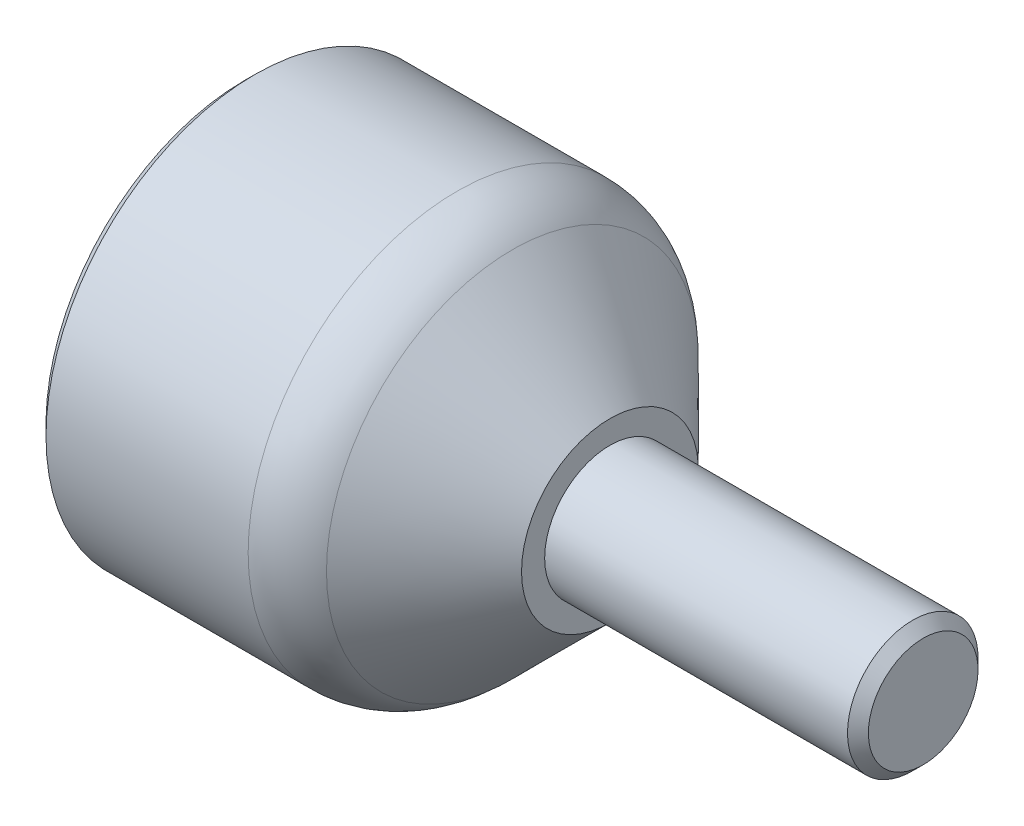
ISO-10303-21;
HEADER;
FILE_DESCRIPTION(('STEP AP214'),'2;1');
FILE_NAME('part.step','',(''),(''),'','','');
FILE_SCHEMA(('AUTOMOTIVE_DESIGN { 1 0 10303 214 1 1 1 1 }'));
ENDSEC;
DATA;
#1=APPLICATION_CONTEXT('core data for automotive mechanical design processes');
#2=APPLICATION_PROTOCOL_DEFINITION('international standard','automotive_design',2000,#1);
#3=PRODUCT_CONTEXT('',#1,'mechanical');
#4=PRODUCT('Part','Part','',(#3));
#5=PRODUCT_RELATED_PRODUCT_CATEGORY('part','',(#4));
#6=PRODUCT_DEFINITION_FORMATION('','',#4);
#7=PRODUCT_DEFINITION_CONTEXT('part definition',#1,'design');
#8=PRODUCT_DEFINITION('design','',#6,#7);
#9=PRODUCT_DEFINITION_SHAPE('','',#8);
#10=(LENGTH_UNIT() NAMED_UNIT(*) SI_UNIT(.MILLI.,.METRE.));
#11=(NAMED_UNIT(*) PLANE_ANGLE_UNIT() SI_UNIT($,.RADIAN.));
#12=(NAMED_UNIT(*) SI_UNIT($,.STERADIAN.) SOLID_ANGLE_UNIT());
#13=UNCERTAINTY_MEASURE_WITH_UNIT(LENGTH_MEASURE(1.E-05),#10,'distance_accuracy_value','');
#14=(GEOMETRIC_REPRESENTATION_CONTEXT(3) GLOBAL_UNCERTAINTY_ASSIGNED_CONTEXT((#13)) GLOBAL_UNIT_ASSIGNED_CONTEXT((#10,
#11,#12)) REPRESENTATION_CONTEXT('',''));
#15=CARTESIAN_POINT('',(0.,0.,0.));
#16=DIRECTION('',(0.,0.,1.));
#17=DIRECTION('',(1.,0.,0.));
#18=AXIS2_PLACEMENT_3D('',#15,#16,#17);
#19=CARTESIAN_POINT('',(111.001,0.,0.));
#20=DIRECTION('',(-1.,0.,0.));
#21=DIRECTION('',(0.,0.,1.));
#22=AXIS2_PLACEMENT_3D('',#19,#20,#21);
#23=CYLINDRICAL_SURFACE('',#22,7.);
#24=CARTESIAN_POINT('',(-9.,0.,0.));
#25=DIRECTION('',(-1.,0.,0.));
#26=DIRECTION('',(0.,0.,1.));
#27=AXIS2_PLACEMENT_3D('',#24,#25,#26);
#28=CIRCLE('',#27,7.);
#29=CARTESIAN_POINT('',(-9.,0.,7.00000000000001));
#30=VERTEX_POINT('',#29);
#31=EDGE_CURVE('E189',#30,#30,#28,.T.);
#32=ORIENTED_EDGE('',*,*,#31,.T.);
#33=EDGE_LOOP('',(#32));
#34=FACE_BOUND('',#33,.T.);
#35=CARTESIAN_POINT('',(0.,0.,0.));
#36=DIRECTION('',(1.,0.,0.));
#37=DIRECTION('',(0.,1.,0.));
#38=AXIS2_PLACEMENT_3D('',#35,#36,#37);
#39=CIRCLE('',#38,7.);
#40=CARTESIAN_POINT('',(0.,6.99999999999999,0.));
#41=VERTEX_POINT('',#40);
#42=EDGE_CURVE('E10',#41,#41,#39,.F.);
#43=ORIENTED_EDGE('',*,*,#42,.F.);
#44=EDGE_LOOP('',(#43));
#45=FACE_BOUND('',#44,.T.);
#46=ADVANCED_FACE('F37',(#34,#45),#23,.F.);
#47=CARTESIAN_POINT('',(0.,40.001,0.));
#48=DIRECTION('',(0.,-1.,0.));
#49=DIRECTION('',(0.,0.,-1.));
#50=AXIS2_PLACEMENT_3D('',#47,#48,#49);
#51=CYLINDRICAL_SURFACE('',#50,7.);
#52=CARTESIAN_POINT('',(0.,33.2716095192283,-6.99999999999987));
#53=CARTESIAN_POINT('',(0.194412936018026,33.2716072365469,-7.00000407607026));
#54=CARTESIAN_POINT('',(0.388775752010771,33.2733166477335,-6.99189874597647));
#55=CARTESIAN_POINT('',(0.776152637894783,33.2800984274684,-6.95955070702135));
#56=CARTESIAN_POINT('',(0.969166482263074,33.2851713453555,-6.93530536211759));
#57=CARTESIAN_POINT('',(1.35248748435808,33.2985359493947,-6.87084989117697));
#58=CARTESIAN_POINT('',(1.54279324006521,33.3068292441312,-6.83063178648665));
#59=CARTESIAN_POINT('',(1.91932685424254,33.3263927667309,-6.73453406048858));
#60=CARTESIAN_POINT('',(2.10555318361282,33.337664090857,-6.67864867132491));
#61=CARTESIAN_POINT('',(2.4722939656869,33.3628357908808,-6.55174495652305));
#62=CARTESIAN_POINT('',(2.65281611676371,33.3767324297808,-6.48074812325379));
#63=CARTESIAN_POINT('',(3.00725875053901,33.4067718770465,-6.32407723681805));
#64=CARTESIAN_POINT('',(3.18117676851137,33.4229155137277,-6.23839776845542));
#65=CARTESIAN_POINT('',(3.52110253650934,33.4569809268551,-6.05304039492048));
#66=CARTESIAN_POINT('',(3.68711368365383,33.474901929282,-5.95336857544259));
#67=CARTESIAN_POINT('',(4.01027330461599,33.5120353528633,-5.7406569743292));
#68=CARTESIAN_POINT('',(4.16741843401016,33.5312482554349,-5.62761219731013));
#69=CARTESIAN_POINT('',(4.47374532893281,33.5706869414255,-5.3873909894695));
#70=CARTESIAN_POINT('',(4.6227960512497,33.5909226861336,-5.26004905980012));
#71=CARTESIAN_POINT('',(4.90973466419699,33.6316117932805,-4.9932849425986));
#72=CARTESIAN_POINT('',(5.04761839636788,33.6520652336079,-4.85385829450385));
#73=CARTESIAN_POINT('',(5.3111925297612,33.6926076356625,-4.56394591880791));
#74=CARTESIAN_POINT('',(5.43688649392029,33.7126967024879,-4.41346344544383));
#75=CARTESIAN_POINT('',(5.67530760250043,33.751967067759,-4.10235374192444));
#76=CARTESIAN_POINT('',(5.78802995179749,33.7711480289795,-3.94172279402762));
#77=CARTESIAN_POINT('',(6.00062504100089,33.8082303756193,-3.60994037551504));
#78=CARTESIAN_POINT('',(6.10037145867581,33.8261185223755,-3.43870644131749));
#79=CARTESIAN_POINT('',(6.28506074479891,33.8599134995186,-3.08824300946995));
#80=CARTESIAN_POINT('',(6.37000354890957,33.8758203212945,-2.90901347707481));
#81=CARTESIAN_POINT('',(6.52443018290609,33.9051978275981,-2.54383703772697));
#82=CARTESIAN_POINT('',(6.5939153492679,33.9186687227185,-2.35789071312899));
#83=CARTESIAN_POINT('',(6.71688882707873,33.9427894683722,-1.98059890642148));
#84=CARTESIAN_POINT('',(6.77037701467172,33.9534392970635,-1.78925338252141));
#85=CARTESIAN_POINT('',(6.86028137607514,33.9714813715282,-1.40529818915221));
#86=CARTESIAN_POINT('',(6.89692798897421,33.9789174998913,-1.21274453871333));
#87=CARTESIAN_POINT('',(6.95396608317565,33.9905408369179,-0.825081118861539));
#88=CARTESIAN_POINT('',(6.97435195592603,33.9947269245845,-0.629970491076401));
#89=CARTESIAN_POINT('',(6.99866883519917,33.9997236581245,-0.238758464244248));
#90=CARTESIAN_POINT('',(7.00260729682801,34.0005358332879,-0.042657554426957));
#91=CARTESIAN_POINT('',(6.99403653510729,33.9987732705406,0.349188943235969));
#92=CARTESIAN_POINT('',(6.98152127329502,33.9961972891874,0.544934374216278));
#93=CARTESIAN_POINT('',(6.91999718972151,33.9835896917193,1.1234336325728));
#94=CARTESIAN_POINT('',(6.84739391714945,33.9687556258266,1.50385934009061));
#95=CARTESIAN_POINT('',(6.64084497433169,33.927728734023,2.24679548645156));
#96=CARTESIAN_POINT('',(6.50689674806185,33.9015354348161,2.60930517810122));
#97=CARTESIAN_POINT('',(6.1805637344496,33.8404135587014,3.30917029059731));
#98=CARTESIAN_POINT('',(5.98779804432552,33.8054283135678,3.6463433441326));
#99=CARTESIAN_POINT('',(5.5495843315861,33.7305709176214,4.28390305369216));
#100=CARTESIAN_POINT('',(5.30412990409,33.6906981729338,4.58428523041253));
#101=CARTESIAN_POINT('',(4.76213139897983,33.6095960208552,5.14558800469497));
#102=CARTESIAN_POINT('',(4.46472784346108,33.5683551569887,5.4056777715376));
#103=CARTESIAN_POINT('',(3.83010525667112,33.489860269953,5.87243128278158));
#104=CARTESIAN_POINT('',(3.49288537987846,33.4526063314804,6.07909389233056));
#105=CARTESIAN_POINT('',(2.7869637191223,33.3862783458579,6.43343966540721));
#106=CARTESIAN_POINT('',(2.41818901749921,33.3572239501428,6.58098148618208));
#107=CARTESIAN_POINT('',(1.66034526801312,33.3108676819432,6.81176125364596));
#108=CARTESIAN_POINT('',(1.27127904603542,33.2935641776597,6.89500812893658));
#109=CARTESIAN_POINT('',(0.491446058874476,33.2729976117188,6.99357896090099));
#110=CARTESIAN_POINT('',(0.100837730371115,33.2694859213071,7.01010585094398));
#111=CARTESIAN_POINT('',(-0.677553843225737,33.2762322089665,6.97801048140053));
#112=CARTESIAN_POINT('',(-1.06533725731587,33.2864893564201,6.92939215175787));
#113=CARTESIAN_POINT('',(-1.82298372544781,33.3193841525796,6.7694259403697));
#114=CARTESIAN_POINT('',(-2.19298982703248,33.3418936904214,6.65872681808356));
#115=CARTESIAN_POINT('',(-2.90920350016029,33.3966437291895,6.37843634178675));
#116=CARTESIAN_POINT('',(-3.25540900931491,33.4288850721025,6.2088398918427));
#117=CARTESIAN_POINT('',(-3.91943869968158,33.5000206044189,5.8128733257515));
#118=CARTESIAN_POINT('',(-4.23680680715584,33.5390002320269,5.58575411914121));
#119=CARTESIAN_POINT('',(-4.82936927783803,33.6189892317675,5.08216279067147));
#120=CARTESIAN_POINT('',(-5.10455902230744,33.6599988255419,4.80568527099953));
#121=CARTESIAN_POINT('',(-5.6095276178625,33.740235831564,4.20588452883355));
#122=CARTESIAN_POINT('',(-5.83849078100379,33.7794231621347,3.88186952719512));
#123=CARTESIAN_POINT('',(-6.23878203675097,33.8508993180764,3.19905423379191));
#124=CARTESIAN_POINT('',(-6.4101126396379,33.8831884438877,2.84025545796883));
#125=CARTESIAN_POINT('',(-6.61943469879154,33.9236259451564,2.2851895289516));
#126=CARTESIAN_POINT('',(-6.68116918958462,33.9357523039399,2.09783814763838));
#127=CARTESIAN_POINT('',(-6.78864479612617,33.9570741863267,1.71845733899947));
#128=CARTESIAN_POINT('',(-6.83439178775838,33.9662707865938,1.52642965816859));
#129=CARTESIAN_POINT('',(-6.90952004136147,33.9814673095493,1.1390698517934));
#130=CARTESIAN_POINT('',(-6.93889987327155,33.9874669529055,0.943737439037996));
#131=CARTESIAN_POINT('',(-6.98105384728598,33.9960980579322,0.551216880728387));
#132=CARTESIAN_POINT('',(-6.9938286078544,33.9987296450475,0.35402880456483));
#133=CARTESIAN_POINT('',(-7.00258398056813,34.0005318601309,-0.0370938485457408));
#134=CARTESIAN_POINT('',(-6.99886986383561,33.9997653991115,-0.231021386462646));
#135=CARTESIAN_POINT('',(-6.97537098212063,33.9949359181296,-0.61785597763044));
#136=CARTESIAN_POINT('',(-6.95558652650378,33.990872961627,-0.810763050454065));
#137=CARTESIAN_POINT('',(-6.90010112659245,33.9795623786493,-1.19421068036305));
#138=CARTESIAN_POINT('',(-6.86439756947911,33.972314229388,-1.38475084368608));
#139=CARTESIAN_POINT('',(-6.77737104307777,33.9548368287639,-1.76201720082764));
#140=CARTESIAN_POINT('',(-6.72605365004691,33.944608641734,-1.94874473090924));
#141=CARTESIAN_POINT('',(-6.60832184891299,33.9214769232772,-2.31674823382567));
#142=CARTESIAN_POINT('',(-6.54194108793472,33.9085793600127,-2.49803535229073));
#143=CARTESIAN_POINT('',(-6.39454173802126,33.8804506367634,-2.85429237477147));
#144=CARTESIAN_POINT('',(-6.31352832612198,33.8652203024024,-3.02926448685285));
#145=CARTESIAN_POINT('',(-6.13739767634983,33.832826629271,-3.37186367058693));
#146=CARTESIAN_POINT('',(-6.04227458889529,33.8156624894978,-3.53948765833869));
#147=CARTESIAN_POINT('',(-5.8386526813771,33.7798731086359,-3.86615662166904));
#148=CARTESIAN_POINT('',(-5.73015844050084,33.7612483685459,-4.0252045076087));
#149=CARTESIAN_POINT('',(-5.49850816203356,33.7226974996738,-4.33643752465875));
#150=CARTESIAN_POINT('',(-5.3751300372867,33.7027543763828,-4.48845529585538));
#151=CARTESIAN_POINT('',(-5.11615913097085,33.6624231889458,-4.78154209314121));
#152=CARTESIAN_POINT('',(-4.98057064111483,33.642035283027,-4.92261493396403));
#153=CARTESIAN_POINT('',(-4.69797036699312,33.6013596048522,-5.19300882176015));
#154=CARTESIAN_POINT('',(-4.55095179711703,33.5810718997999,-5.32232278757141));
#155=CARTESIAN_POINT('',(-4.24660171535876,33.5411818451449,-5.56818005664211));
#156=CARTESIAN_POINT('',(-4.08927400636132,33.5215792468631,-5.68472802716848));
#157=CARTESIAN_POINT('',(-3.7633680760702,33.4833756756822,-5.90561354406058));
#158=CARTESIAN_POINT('',(-3.59467786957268,33.4647894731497,-6.0097885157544));
#159=CARTESIAN_POINT('',(-3.24899006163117,33.4294239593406,-6.20349152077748));
#160=CARTESIAN_POINT('',(-3.07199555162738,33.4126439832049,-6.29302494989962));
#161=CARTESIAN_POINT('',(-2.71097647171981,33.3813884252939,-6.45676856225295));
#162=CARTESIAN_POINT('',(-2.52695614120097,33.3669114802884,-6.53098781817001));
#163=CARTESIAN_POINT('',(-2.15316639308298,33.3406858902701,-6.66357367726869));
#164=CARTESIAN_POINT('',(-1.96339807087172,33.3289367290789,-6.72194328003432));
#165=CARTESIAN_POINT('',(-1.48292176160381,33.3033976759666,-6.84760925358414));
#166=CARTESIAN_POINT('',(-1.18936842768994,33.2915446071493,-6.90467527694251));
#167=CARTESIAN_POINT('',(-0.597170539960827,33.2756524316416,-6.98086679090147));
#168=CARTESIAN_POINT('',(-0.298526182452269,33.2716130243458,-6.99999374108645));
#169=CARTESIAN_POINT('',(0.,33.2716095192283,-6.99999999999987));
#170=B_SPLINE_CURVE_WITH_KNOTS('',3,(#52,#53,#54,#55,#56,#57,#58,#59,#60,#61,#62,#63,#64,#65,
#66,#67,#68,#69,#70,#71,#72,#73,#74,#75,#76,#77,#78,#79,#80,#81,#82,#83,#84,#85,#86,#87,#88,#89,
#90,#91,#92,#93,#94,#95,#96,#97,#98,#99,#100,#101,#102,#103,#104,#105,#106,#107,#108,#109,#110,
#111,#112,#113,#114,#115,#116,#117,#118,#119,#120,#121,#122,#123,#124,#125,#126,#127,#128,#129,
#130,#131,#132,#133,#134,#135,#136,#137,#138,#139,#140,#141,#142,#143,#144,#145,#146,#147,#148,
#149,#150,#151,#152,#153,#154,#155,#156,#157,#158,#159,#160,#161,#162,#163,#164,#165,#166,#167,
#168,#169),.UNSPECIFIED.,.T.,.F.,(4,2,2,2,2,2,2,2,2,2,2,2,2,2,2,2,2,2,2,2,2,2,2,2,2,2,2,2,2,2,2,
2,2,2,2,2,2,2,2,2,2,2,2,2,2,2,2,2,2,2,2,2,2,2,2,2,2,2,4),(0.,0.582976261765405,1.16604776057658,
1.74941088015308,2.33298904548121,2.91574269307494,3.4987117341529,4.08142800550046,
4.66436263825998,5.25492191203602,5.84570010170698,6.43630508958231,7.0271277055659,
7.62332903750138,8.21953296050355,8.81568531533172,9.41184228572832,9.9995797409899,
10.5875198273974,11.1751933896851,11.7630826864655,12.9198468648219,14.0766592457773,
15.2411281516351,16.4057386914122,17.5918481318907,18.777982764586,19.9669364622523,
21.1557250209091,22.3229818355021,23.4901682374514,24.6453786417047,25.800689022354,
26.97189638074,28.143231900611,29.3337113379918,30.5241389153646,31.1164428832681,
31.7085289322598,32.3006667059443,32.8927824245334,33.4739820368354,34.0551704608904,
34.636454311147,35.2175308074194,35.7973219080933,36.3769082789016,36.9567356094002,
37.536364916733,38.126070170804,38.7155689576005,39.3054204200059,39.8950555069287,
40.4917373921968,41.0881988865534,41.6843059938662,42.2803002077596,43.1755100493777,
44.070685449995),.UNSPECIFIED.);
#171=CARTESIAN_POINT('',(0.,33.2716095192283,-6.99999999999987));
#172=VERTEX_POINT('',#171);
#173=EDGE_CURVE('E111',#172,#172,#170,.T.);
#174=ORIENTED_EDGE('',*,*,#173,.T.);
#175=EDGE_LOOP('',(#174));
#176=FACE_BOUND('',#175,.T.);
#177=CARTESIAN_POINT('',(0.,12.1243556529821,-6.9999999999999));
#178=CARTESIAN_POINT('',(0.18246413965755,12.1243567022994,-6.9999992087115));
#179=CARTESIAN_POINT('',(0.364944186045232,12.1284887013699,-6.99285621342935));
#180=CARTESIAN_POINT('',(0.728497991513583,12.1448632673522,-6.96437790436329));
#181=CARTESIAN_POINT('',(0.909571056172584,12.1571096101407,-6.94303598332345));
#182=CARTESIAN_POINT('',(1.26911638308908,12.1892798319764,-6.88640077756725));
#183=CARTESIAN_POINT('',(1.44758410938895,12.2092157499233,-6.85108561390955));
#184=CARTESIAN_POINT('',(1.80043404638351,12.2560580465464,-6.76693105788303));
#185=CARTESIAN_POINT('',(1.97481444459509,12.2829674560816,-6.71808578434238));
#186=CARTESIAN_POINT('',(2.31733169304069,12.3426800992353,-6.60773436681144));
#187=CARTESIAN_POINT('',(2.48549890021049,12.3754482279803,-6.54630333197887));
#188=CARTESIAN_POINT('',(2.81577578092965,12.4459843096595,-6.41118434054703));
#189=CARTESIAN_POINT('',(2.97788308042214,12.4837541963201,-6.337491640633));
#190=CARTESIAN_POINT('',(3.45378734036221,12.6029546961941,-6.09894287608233));
#191=CARTESIAN_POINT('',(3.75749075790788,12.690336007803,-5.91651060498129));
#192=CARTESIAN_POINT('',(4.35618674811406,12.8797874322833,-5.49265770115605));
#193=CARTESIAN_POINT('',(4.64839489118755,12.9824746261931,-5.24761284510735));
#194=CARTESIAN_POINT('',(5.18987778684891,13.1860486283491,-4.71272803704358));
#195=CARTESIAN_POINT('',(5.43913112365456,13.2869345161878,-4.42286587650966));
#196=CARTESIAN_POINT('',(5.78372064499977,13.4327832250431,-3.9484618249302));
#197=CARTESIAN_POINT('',(5.89668216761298,13.4819112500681,-3.77772960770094));
#198=CARTESIAN_POINT('',(6.10768242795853,13.5755233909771,-3.42610483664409));
#199=CARTESIAN_POINT('',(6.20572752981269,13.6200094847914,-3.24521666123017));
#200=CARTESIAN_POINT('',(6.38592686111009,13.7030533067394,-2.8744434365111));
#201=CARTESIAN_POINT('',(6.46808495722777,13.7416124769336,-2.68456059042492));
#202=CARTESIAN_POINT('',(6.61560338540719,13.8116613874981,-2.29711576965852));
#203=CARTESIAN_POINT('',(6.68096550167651,13.8431518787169,-2.09955461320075));
#204=CARTESIAN_POINT('',(6.79002031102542,13.8961243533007,-1.7126311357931));
#205=CARTESIAN_POINT('',(6.83492373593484,13.9181589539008,-1.52368532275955));
#206=CARTESIAN_POINT('',(6.90895142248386,13.9546612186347,-1.14200326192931));
#207=CARTESIAN_POINT('',(6.93807637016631,13.969129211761,-0.949267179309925));
#208=CARTESIAN_POINT('',(6.98014788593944,13.9900726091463,-0.561703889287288));
#209=CARTESIAN_POINT('',(6.99310269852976,13.9965520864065,-0.366877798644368));
#210=CARTESIAN_POINT('',(7.0026800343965,14.0013395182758,0.0232709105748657));
#211=CARTESIAN_POINT('',(6.99930355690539,13.99964797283,0.218593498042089));
#212=CARTESIAN_POINT('',(6.97727738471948,13.9886498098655,0.591019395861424));
#213=CARTESIAN_POINT('',(6.95998630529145,13.9800206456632,0.768225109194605));
#214=CARTESIAN_POINT('',(6.9120347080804,13.9562097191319,1.12043394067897));
#215=CARTESIAN_POINT('',(6.88136966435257,13.9410257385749,1.29543629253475));
#216=CARTESIAN_POINT('',(6.80701684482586,13.904475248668,1.64192217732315));
#217=CARTESIAN_POINT('',(6.76333361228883,13.883110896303,1.81340691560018));
#218=CARTESIAN_POINT('',(6.66336821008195,13.8346870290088,2.1519024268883));
#219=CARTESIAN_POINT('',(6.60708114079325,13.807625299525,2.31891143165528));
#220=CARTESIAN_POINT('',(6.48159900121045,13.7480192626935,2.64963539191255));
#221=CARTESIAN_POINT('',(6.41224096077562,13.7154063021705,2.81327614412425));
#222=CARTESIAN_POINT('',(6.26171543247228,13.6456823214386,3.13406186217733));
#223=CARTESIAN_POINT('',(6.18054396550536,13.6085697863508,3.29120461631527));
#224=CARTESIAN_POINT('',(5.92023970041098,13.4916670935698,3.75166354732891));
#225=CARTESIAN_POINT('',(5.72424187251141,13.406275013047,4.04420673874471));
#226=CARTESIAN_POINT('',(5.27167199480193,13.219084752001,4.62129859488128));
#227=CARTESIAN_POINT('',(5.01112534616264,13.1164987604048,4.90247755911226));
#228=CARTESIAN_POINT('',(4.58875349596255,12.9630037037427,5.28960602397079));
#229=CARTESIAN_POINT('',(4.44258442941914,12.911864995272,5.41295389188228));
#230=CARTESIAN_POINT('',(4.14027498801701,12.8109940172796,5.64753995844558));
#231=CARTESIAN_POINT('',(3.98413305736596,12.7612619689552,5.75877626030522));
#232=CARTESIAN_POINT('',(3.65236629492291,12.6614842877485,5.97510752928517));
#233=CARTESIAN_POINT('',(3.47613404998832,12.6116214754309,6.07935656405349));
#234=CARTESIAN_POINT('',(3.11426430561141,12.5167161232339,6.27243073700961));
#235=CARTESIAN_POINT('',(2.92863109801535,12.471671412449,6.36126283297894));
#236=CARTESIAN_POINT('',(2.54911797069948,12.3880497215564,6.52261333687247));
#237=CARTESIAN_POINT('',(2.35524300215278,12.3494689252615,6.5951413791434));
#238=CARTESIAN_POINT('',(1.96052934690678,12.2803075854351,6.723045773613));
#239=CARTESIAN_POINT('',(1.7596916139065,12.2497259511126,6.77842446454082));
#240=CARTESIAN_POINT('',(1.36884668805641,12.1999672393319,6.86754639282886));
#241=CARTESIAN_POINT('',(1.17924143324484,12.1800787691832,6.90265574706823));
#242=CARTESIAN_POINT('',(0.797071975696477,12.1490357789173,6.95714891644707));
#243=CARTESIAN_POINT('',(0.604507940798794,12.1378807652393,6.97653362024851));
#244=CARTESIAN_POINT('',(0.218238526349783,12.1247842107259,6.99927005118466));
#245=CARTESIAN_POINT('',(0.0245339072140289,12.1228371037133,7.00263146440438));
#246=CARTESIAN_POINT('',(-0.362350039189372,12.1282271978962,6.99329223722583));
#247=CARTESIAN_POINT('',(-0.555529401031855,12.135563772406,6.98059268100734));
#248=CARTESIAN_POINT('',(-0.918518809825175,12.1579000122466,6.94160642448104));
#249=CARTESIAN_POINT('',(-1.0885664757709,12.1719701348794,6.91696414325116));
#250=CARTESIAN_POINT('',(-1.42578986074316,12.2067498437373,6.85539993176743));
#251=CARTESIAN_POINT('',(-1.59296461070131,12.227461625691,6.81847394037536));
#252=CARTESIAN_POINT('',(-1.92333755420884,12.2748725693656,6.73274811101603));
#253=CARTESIAN_POINT('',(-2.08653626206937,12.3015709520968,6.68394981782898));
#254=CARTESIAN_POINT('',(-2.40816554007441,12.3601877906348,6.5749210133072));
#255=CARTESIAN_POINT('',(-2.56659422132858,12.3921082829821,6.51468604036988));
#256=CARTESIAN_POINT('',(-2.88502422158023,12.4618671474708,6.38027098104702));
#257=CARTESIAN_POINT('',(-3.04476388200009,12.4999099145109,6.30557767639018));
#258=CARTESIAN_POINT('',(-3.35747437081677,12.5797363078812,6.14477755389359));
#259=CARTESIAN_POINT('',(-3.5104429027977,12.6215211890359,6.05866690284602));
#260=CARTESIAN_POINT('',(-3.80897876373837,12.7077885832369,5.87557234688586));
#261=CARTESIAN_POINT('',(-3.95454423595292,12.7522717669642,5.77858573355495));
#262=CARTESIAN_POINT('',(-4.23768542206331,12.8428962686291,5.57427175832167));
#263=CARTESIAN_POINT('',(-4.37526061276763,12.8890376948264,5.46694372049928));
#264=CARTESIAN_POINT('',(-4.65872784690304,12.9878380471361,5.22826714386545));
#265=CARTESIAN_POINT('',(-4.80347888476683,13.0405847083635,5.09559651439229));
#266=CARTESIAN_POINT('',(-5.08143547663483,13.1455095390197,4.81845755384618));
#267=CARTESIAN_POINT('',(-5.21464068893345,13.1976876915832,4.67398887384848));
#268=CARTESIAN_POINT('',(-5.46881355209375,13.3001649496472,4.37387305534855));
#269=CARTESIAN_POINT('',(-5.58977401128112,13.3504629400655,4.21821943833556));
#270=CARTESIAN_POINT('',(-5.81850549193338,13.4478362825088,3.89665325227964));
#271=CARTESIAN_POINT('',(-5.92628210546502,13.4949129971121,3.73074507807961));
#272=CARTESIAN_POINT('',(-6.13058093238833,13.5858539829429,3.384877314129));
#273=CARTESIAN_POINT('',(-6.22672055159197,13.6295971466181,3.20465923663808));
#274=CARTESIAN_POINT('',(-6.40327038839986,13.7111539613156,2.8354838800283));
#275=CARTESIAN_POINT('',(-6.48368800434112,13.74897039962,2.64653076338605));
#276=CARTESIAN_POINT('',(-6.62790265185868,13.8175638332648,2.26123761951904));
#277=CARTESIAN_POINT('',(-6.69170738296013,13.848344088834,2.06490106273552));
#278=CARTESIAN_POINT('',(-6.80191335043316,13.9019315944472,1.66634531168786));
#279=CARTESIAN_POINT('',(-6.84831665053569,13.9247397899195,1.4641268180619));
#280=CARTESIAN_POINT('',(-6.91963267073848,13.9599588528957,1.07436350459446));
#281=CARTESIAN_POINT('',(-6.94612706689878,13.9731319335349,0.887175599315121));
#282=CARTESIAN_POINT('',(-6.98389068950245,13.9919426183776,0.510896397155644));
#283=CARTESIAN_POINT('',(-6.99516088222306,13.9975807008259,0.321805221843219));
#284=CARTESIAN_POINT('',(-7.00232854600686,14.0011640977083,-0.0566831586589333));
#285=CARTESIAN_POINT('',(-6.9982305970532,13.999111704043,-0.246080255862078));
#286=CARTESIAN_POINT('',(-6.97472603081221,13.9873764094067,-0.62368009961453));
#287=CARTESIAN_POINT('',(-6.95531983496,13.9776937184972,-0.811882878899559));
#288=CARTESIAN_POINT('',(-6.90323694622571,13.9518532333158,-1.17320125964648));
#289=CARTESIAN_POINT('',(-6.87152386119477,13.9361665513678,-1.34649081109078));
#290=CARTESIAN_POINT('',(-6.7952974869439,13.8987396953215,-1.68962418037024));
#291=CARTESIAN_POINT('',(-6.75077983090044,13.8769974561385,-1.85946680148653));
#292=CARTESIAN_POINT('',(-6.6494066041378,13.8279659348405,-2.19454399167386));
#293=CARTESIAN_POINT('',(-6.59255464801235,13.8006782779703,-2.35977989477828));
#294=CARTESIAN_POINT('',(-6.46699905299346,13.7411434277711,-2.68482684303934));
#295=CARTESIAN_POINT('',(-6.39829080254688,13.7088943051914,-2.844635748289));
#296=CARTESIAN_POINT('',(-6.24643580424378,13.6386668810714,-3.16460235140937));
#297=CARTESIAN_POINT('',(-6.16280060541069,13.6005037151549,-3.32448787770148));
#298=CARTESIAN_POINT('',(-5.98390892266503,13.5203840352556,-3.63665051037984));
#299=CARTESIAN_POINT('',(-5.8886484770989,13.4784262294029,-3.78892499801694));
#300=CARTESIAN_POINT('',(-5.5863965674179,13.3482074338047,-4.23325272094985));
#301=CARTESIAN_POINT('',(-5.36285986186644,13.2555654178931,-4.51296640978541));
#302=CARTESIAN_POINT('',(-4.85234316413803,13.0569770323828,-5.06048053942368));
#303=CARTESIAN_POINT('',(-4.56126325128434,12.9506241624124,-5.32432501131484));
#304=CARTESIAN_POINT('',(-4.09379297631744,12.7959953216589,-5.68150043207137));
#305=CARTESIAN_POINT('',(-3.93267969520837,12.7452285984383,-5.79420532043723));
#306=CARTESIAN_POINT('',(-3.6007955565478,12.6467632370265,-6.00608071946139));
#307=CARTESIAN_POINT('',(-3.43002335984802,12.5990650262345,-6.10524934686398));
#308=CARTESIAN_POINT('',(-3.07413488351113,12.5067917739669,-6.292168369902));
#309=CARTESIAN_POINT('',(-2.88873450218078,12.4623654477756,-6.37945203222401));
#310=CARTESIAN_POINT('',(-2.50983099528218,12.3800279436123,-6.53780350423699));
#311=CARTESIAN_POINT('',(-2.3163321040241,12.3421134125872,-6.60887966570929));
#312=CARTESIAN_POINT('',(-1.92303200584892,12.2743893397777,-6.73382591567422));
#313=CARTESIAN_POINT('',(-1.72324849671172,12.2445589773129,-6.78774026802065));
#314=CARTESIAN_POINT('',(-1.31867019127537,12.1942067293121,-6.87779048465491));
#315=CARTESIAN_POINT('',(-1.11387900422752,12.1736783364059,-6.91393877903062));
#316=CARTESIAN_POINT('',(-0.757403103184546,12.1470656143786,-6.96055223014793));
#317=CARTESIAN_POINT('',(-0.606446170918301,12.1385700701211,-6.9753310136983));
#318=CARTESIAN_POINT('',(-0.303663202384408,12.1272144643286,-6.99505555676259));
#319=CARTESIAN_POINT('',(-0.151837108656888,12.1243547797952,-7.00000065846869));
#320=CARTESIAN_POINT('',(0.,12.1243556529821,-6.9999999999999));
#321=B_SPLINE_CURVE_WITH_KNOTS('',3,(#177,#178,#179,#180,#181,#182,#183,#184,#185,#186,#187,
#188,#189,#190,#191,#192,#193,#194,#195,#196,#197,#198,#199,#200,#201,#202,#203,#204,#205,#206,
#207,#208,#209,#210,#211,#212,#213,#214,#215,#216,#217,#218,#219,#220,#221,#222,#223,#224,#225,
#226,#227,#228,#229,#230,#231,#232,#233,#234,#235,#236,#237,#238,#239,#240,#241,#242,#243,#244,
#245,#246,#247,#248,#249,#250,#251,#252,#253,#254,#255,#256,#257,#258,#259,#260,#261,#262,#263,
#264,#265,#266,#267,#268,#269,#270,#271,#272,#273,#274,#275,#276,#277,#278,#279,#280,#281,#282,
#283,#284,#285,#286,#287,#288,#289,#290,#291,#292,#293,#294,#295,#296,#297,#298,#299,#300,#301,
#302,#303,#304,#305,#306,#307,#308,#309,#310,#311,#312,#313,#314,#315,#316,#317,#318,#319,#320),
.UNSPECIFIED.,.T.,.F.,(4,2,2,2,2,2,2,2,2,2,2,2,2,2,2,2,2,2,2,2,2,2,2,2,2,2,2,2,2,2,2,2,2,2,2,2,
2,2,2,2,2,2,2,2,2,2,2,2,2,2,2,2,2,2,2,2,2,2,2,2,2,2,2,2,2,2,2,2,2,2,2,4),(0.,0.547235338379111,
1.09472550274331,1.64307632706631,2.19166587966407,2.73707224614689,3.2826900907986,
4.37289899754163,5.55302610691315,6.7337398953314,7.36464521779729,7.99528060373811,
8.62576230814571,9.25617700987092,9.8417460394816,10.4272896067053,11.012534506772,
11.5977435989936,12.1318812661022,12.666199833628,13.200332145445,13.7346724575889,
14.2761780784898,14.8178665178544,15.9006100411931,17.085702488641,17.679127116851,
18.2726445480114,18.9040673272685,19.53520439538,20.1659675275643,20.7966446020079,
21.3773740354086,21.9580706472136,22.5384161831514,23.118722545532,23.6353309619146,
24.1521103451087,24.6688225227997,25.1857366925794,25.7263797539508,26.2672047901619,
26.8081648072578,27.3491602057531,27.9584191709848,28.5676961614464,29.1773289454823,
29.7867022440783,30.41253419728,31.0380709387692,31.6633172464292,32.2884893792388,
32.8562758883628,33.4240263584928,33.9916076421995,34.5591733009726,35.0891641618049,
35.6193359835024,36.149352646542,36.6795759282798,37.2322671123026,37.7851471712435,
38.8903827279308,40.1056115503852,40.7142478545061,41.3229687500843,41.9511619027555,
42.5790306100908,43.205266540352,43.8310636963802,44.2864138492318,44.7417944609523),.UNSPECIFIED.);
#322=CARTESIAN_POINT('',(0.,12.1243556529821,-6.9999999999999));
#323=VERTEX_POINT('',#322);
#324=EDGE_CURVE('E60',#323,#323,#321,.T.);
#325=ORIENTED_EDGE('',*,*,#324,.F.);
#326=EDGE_LOOP('',(#325));
#327=FACE_BOUND('',#326,.T.);
#328=ADVANCED_FACE('F101',(#176,#327),#51,.T.);
#329=CARTESIAN_POINT('',(0.,-27.3211910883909,47.3216910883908));
#330=DIRECTION('',(0.,0.500000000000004,-0.866025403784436));
#331=DIRECTION('',(0.,0.866025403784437,0.500000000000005));
#332=AXIS2_PLACEMENT_3D('',#329,#330,#331);
#333=CYLINDRICAL_SURFACE('',#332,7.);
#334=CARTESIAN_POINT('',(0.,-10.5736269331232,32.314059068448));
#335=CARTESIAN_POINT('',(0.194412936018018,-10.573622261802,32.314059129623));
#336=CARTESIAN_POINT('',(0.388775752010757,-10.5814963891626,32.3114868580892));
#337=CARTESIAN_POINT('',(0.776152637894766,-10.6129015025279,32.3011860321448));
#338=CARTESIAN_POINT('',(0.969166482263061,-10.6364350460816,32.2934566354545));
#339=CARTESIAN_POINT('',(1.35248748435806,-10.6989374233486,32.2728029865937));
#340=CARTESIAN_POINT('',(1.54279324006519,-10.7379139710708,32.2598761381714));
#341=CARTESIAN_POINT('',(1.91932685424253,-10.8309188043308,32.2287697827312));
#342=CARTESIAN_POINT('',(2.10555318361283,-10.88495263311,32.2105883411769));
#343=CARTESIAN_POINT('',(2.47229396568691,-11.0074403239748,32.168935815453));
#344=CARTESIAN_POINT('',(2.65281611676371,-11.0758737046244,32.145472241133));
#345=CARTESIAN_POINT('',(3.007258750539,-11.226574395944,32.0931517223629));
#346=CARTESIAN_POINT('',(3.18117676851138,-11.3088468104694,32.064292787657));
#347=CARTESIAN_POINT('',(3.52110253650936,-11.4864037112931,32.0011156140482));
#348=CARTESIAN_POINT('',(3.68711368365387,-11.5816825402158,31.9667997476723));
#349=CARTESIAN_POINT('',(4.01027330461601,-11.7844629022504,31.8926024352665));
#350=CARTESIAN_POINT('',(4.16741843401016,-11.8919690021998,31.8527189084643));
#351=CARTESIAN_POINT('',(4.47374532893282,-12.1197260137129,31.7667632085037));
#352=CARTESIAN_POINT('',(4.62279605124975,-12.2401252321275,31.7206169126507));
#353=CARTESIAN_POINT('',(4.90973466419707,-12.4914942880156,31.6224726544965));
#354=CARTESIAN_POINT('',(5.04761839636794,-12.6224680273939,31.5704725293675));
#355=CARTESIAN_POINT('',(5.31119252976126,-12.8938107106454,31.4606270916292));
#356=CARTESIAN_POINT('',(5.43688649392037,-13.0341768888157,31.4027834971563));
#357=CARTESIAN_POINT('',(5.67530760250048,-13.3232409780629,31.2812377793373));
#358=CARTESIAN_POINT('',(5.78802995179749,-13.4719419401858,31.2175335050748));
#359=CARTESIAN_POINT('',(6.00062504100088,-13.7778151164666,31.0837565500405));
#360=CARTESIAN_POINT('',(6.10037145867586,-13.9350521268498,31.0136311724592));
#361=CARTESIAN_POINT('',(6.28506074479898,-14.2554598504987,30.8676667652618));
#362=CARTESIAN_POINT('',(6.37000354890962,-14.4186305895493,30.7918277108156));
#363=CARTESIAN_POINT('',(6.52443018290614,-14.7495714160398,30.6346811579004));
#364=CARTESIAN_POINT('',(6.59391534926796,-14.9173411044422,30.5533741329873));
#365=CARTESIAN_POINT('',(6.71688882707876,-15.2561457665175,30.385617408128));
#366=CARTESIAN_POINT('',(6.77037701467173,-15.4271807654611,30.2991676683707));
#367=CARTESIAN_POINT('',(6.86028137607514,-15.7687167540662,30.1228149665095));
#368=CARTESIAN_POINT('',(6.89692798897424,-15.9391911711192,30.0329780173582));
#369=CARTESIAN_POINT('',(6.9539660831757,-16.280729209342,29.849212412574));
#370=CARTESIAN_POINT('',(6.97435195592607,-16.4517930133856,29.7552823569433));
#371=CARTESIAN_POINT('',(6.99866883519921,-16.7930909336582,29.5640036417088));
#372=CARTESIAN_POINT('',(7.00260729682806,-16.9633253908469,29.4666565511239));
#373=CARTESIAN_POINT('',(6.99403653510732,-17.3017931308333,29.2692068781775));
#374=CARTESIAN_POINT('',(6.98152127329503,-17.4700256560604,29.1691032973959));
#375=CARTESIAN_POINT('',(6.91999718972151,-17.9647169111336,28.8689351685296));
#376=CARTESIAN_POINT('',(6.84739391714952,-18.2867582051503,28.6658756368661));
#377=CARTESIAN_POINT('',(6.64084497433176,-18.9096463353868,28.2588772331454));
#378=CARTESIAN_POINT('',(6.50689674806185,-19.2104922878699,28.0549383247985));
#379=CARTESIAN_POINT('',(6.18056373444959,-19.7860323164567,27.6520726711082));
#380=CARTESIAN_POINT('',(5.98779804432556,-20.0605401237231,27.4531880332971));
#381=CARTESIAN_POINT('',(5.54958433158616,-20.575254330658,27.0695797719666));
#382=CARTESIAN_POINT('',(5.30412990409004,-20.815456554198,26.8848578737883));
#383=CARTESIAN_POINT('',(4.76213139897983,-21.2610079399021,26.5339699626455));
#384=CARTESIAN_POINT('',(4.46472784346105,-21.4656318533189,26.3682094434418));
#385=CARTESIAN_POINT('',(3.8301052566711,-21.8306048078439,26.0668541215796));
#386=CARTESIAN_POINT('',(3.49288537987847,-21.9909529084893,25.9312599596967));
#387=CARTESIAN_POINT('',(2.78696371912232,-22.2646613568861,25.6966453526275));
#388=CARTESIAN_POINT('',(2.41818901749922,-22.3779091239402,25.5977125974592));
#389=CARTESIAN_POINT('',(1.66034526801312,-22.5545921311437,25.442177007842));
#390=CARTESIAN_POINT('',(1.27127904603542,-22.6180342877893,25.3855682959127));
#391=CARTESIAN_POINT('',(0.491446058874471,-22.6931158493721,25.318471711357));
#392=CARTESIAN_POINT('',(0.100837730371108,-22.7056727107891,25.3071670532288));
#393=CARTESIAN_POINT('',(-0.677553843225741,-22.6812504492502,25.3290571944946));
#394=CARTESIAN_POINT('',(-1.06533725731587,-22.6442743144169,25.362249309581));
#395=CARTESIAN_POINT('',(-1.82298372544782,-22.5221869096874,25.4707201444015));
#396=CARTESIAN_POINT('',(-2.19298982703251,-22.4375734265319,25.5455635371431));
#397=CARTESIAN_POINT('',(-2.9092035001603,-22.222209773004,25.733123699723));
#398=CARTESIAN_POINT('',(-3.25540900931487,-22.0914556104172,25.84584374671));
#399=CARTESIAN_POINT('',(-3.91943869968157,-21.7841062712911,26.1054322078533));
#400=CARTESIAN_POINT('',(-4.23680680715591,-21.6069050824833,26.2527491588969));
#401=CARTESIAN_POINT('',(-4.82936927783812,-21.2107766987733,26.5738173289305));
#402=CARTESIAN_POINT('',(-5.10455902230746,-20.9918449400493,26.747571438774));
#403=CARTESIAN_POINT('',(-5.60952761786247,-20.5125207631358,27.1169590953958));
#404=CARTESIAN_POINT('',(-5.83849078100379,-20.251509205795,27.3129038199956));
#405=CARTESIAN_POINT('',(-6.23878203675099,-19.6959118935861,27.7162116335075));
#406=CARTESIAN_POINT('',(-6.41011263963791,-19.4013276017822,27.9235742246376));
#407=CARTESIAN_POINT('',(-6.61943469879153,-18.9408451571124,28.2361270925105));
#408=CARTESIAN_POINT('',(-6.68116918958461,-18.7846572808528,28.3403045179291));
#409=CARTESIAN_POINT('',(-6.78864479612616,-18.4667648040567,28.5484602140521));
#410=CARTESIAN_POINT('',(-6.83439178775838,-18.3050622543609,28.6524385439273));
#411=CARTESIAN_POINT('',(-6.90952004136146,-17.9771970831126,28.8592790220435));
#412=CARTESIAN_POINT('',(-6.93889987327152,-17.811034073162,28.9621410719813));
#413=CARTESIAN_POINT('',(-6.98105384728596,-17.4754168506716,29.165876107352));
#414=CARTESIAN_POINT('',(-6.99382860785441,-17.3059627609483,29.2667491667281));
#415=CARTESIAN_POINT('',(-7.00258398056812,-16.9681417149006,29.4638712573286));
#416=CARTESIAN_POINT('',(-6.99886986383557,-16.7998123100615,29.5601712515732));
#417=CARTESIAN_POINT('',(-6.97537098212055,-16.4623889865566,29.7494060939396));
#418=CARTESIAN_POINT('',(-6.95558652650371,-16.2932950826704,29.8423410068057));
#419=CARTESIAN_POINT('',(-6.90010112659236,-15.9555644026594,30.0242695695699));
#420=CARTESIAN_POINT('',(-6.86439756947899,-15.7869277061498,30.1132625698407));
#421=CARTESIAN_POINT('',(-6.77737104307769,-15.4514667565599,30.2867598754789));
#422=CARTESIAN_POINT('',(-6.72605365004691,-15.2846418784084,30.3712657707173));
#423=CARTESIAN_POINT('',(-6.60832184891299,-14.9543756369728,30.5352348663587));
#424=CARTESIAN_POINT('',(-6.54194108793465,-14.7909276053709,30.6147088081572));
#425=CARTESIAN_POINT('',(-6.39454173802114,-14.4683356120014,30.7684771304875));
#426=CARTESIAN_POINT('',(-6.31352832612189,-14.3091901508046,30.8427733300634));
#427=CARTESIAN_POINT('',(-6.13739767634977,-13.9962937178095,30.9860191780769));
#428=CARTESIAN_POINT('',(-6.04227458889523,-13.8425450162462,31.054966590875));
#429=CARTESIAN_POINT('',(-5.83865268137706,-13.5417467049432,31.187306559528));
#430=CARTESIAN_POINT('',(-5.73015844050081,-13.3946948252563,31.250701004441));
#431=CARTESIAN_POINT('',(-5.49850816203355,-13.1058836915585,31.3729314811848));
#432=CARTESIAN_POINT('',(-5.37513003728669,-12.96426087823,31.4316691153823));
#433=CARTESIAN_POINT('',(-5.11615913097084,-12.6902746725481,31.5432846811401));
#434=CARTESIAN_POINT('',(-4.98057064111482,-12.5579080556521,31.5961646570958));
#435=CARTESIAN_POINT('',(-4.6979703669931,-12.3034022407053,31.6961354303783));
#436=CARTESIAN_POINT('',(-4.55095179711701,-12.1812692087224,31.7432227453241));
#437=CARTESIAN_POINT('',(-4.24660171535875,-11.9484055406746,31.83160557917));
#438=CARTESIAN_POINT('',(-4.08927400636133,-11.8376707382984,31.8729032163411));
#439=CARTESIAN_POINT('',(-3.76336807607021,-11.6272764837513,31.9502607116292));
#440=CARTESIAN_POINT('',(-3.59467786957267,-11.5277652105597,31.986252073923));
#441=CARTESIAN_POINT('',(-3.24899006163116,-11.3423307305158,32.0524761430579));
#442=CARTESIAN_POINT('',(-3.07199555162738,-11.2564025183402,32.0827109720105));
#443=CARTESIAN_POINT('',(-2.71097647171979,-11.0989686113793,32.1375146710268));
#444=CARTESIAN_POINT('',(-2.52695614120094,-11.0274543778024,32.1620868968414));
#445=CARTESIAN_POINT('',(-2.15316639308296,-10.8995188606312,32.2056677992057));
#446=CARTESIAN_POINT('',(-1.96339807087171,-10.8430947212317,32.2246775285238));
#447=CARTESIAN_POINT('',(-1.48292176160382,-10.72149526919,32.2653930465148));
#448=CARTESIAN_POINT('',(-1.18936842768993,-10.6661481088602,32.2836609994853));
#449=CARTESIAN_POINT('',(-0.597170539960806,-10.5922182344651,32.3079937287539));
#450=CARTESIAN_POINT('',(-0.298526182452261,-10.57363410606,32.3140589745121));
#451=CARTESIAN_POINT('',(0.,-10.5736269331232,32.314059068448));
#452=B_SPLINE_CURVE_WITH_KNOTS('',3,(#334,#335,#336,#337,#338,#339,#340,#341,#342,#343,#344,
#345,#346,#347,#348,#349,#350,#351,#352,#353,#354,#355,#356,#357,#358,#359,#360,#361,#362,#363,
#364,#365,#366,#367,#368,#369,#370,#371,#372,#373,#374,#375,#376,#377,#378,#379,#380,#381,#382,
#383,#384,#385,#386,#387,#388,#389,#390,#391,#392,#393,#394,#395,#396,#397,#398,#399,#400,#401,
#402,#403,#404,#405,#406,#407,#408,#409,#410,#411,#412,#413,#414,#415,#416,#417,#418,#419,#420,
#421,#422,#423,#424,#425,#426,#427,#428,#429,#430,#431,#432,#433,#434,#435,#436,#437,#438,#439,
#440,#441,#442,#443,#444,#445,#446,#447,#448,#449,#450,#451),.UNSPECIFIED.,.T.,.F.,(4,2,2,2,2,2,
2,2,2,2,2,2,2,2,2,2,2,2,2,2,2,2,2,2,2,2,2,2,2,2,2,2,2,2,2,2,2,2,2,2,2,2,2,2,2,2,2,2,2,2,2,2,2,2,
2,2,2,2,4),(0.,0.582976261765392,1.16604776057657,1.74941088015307,2.3329890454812,
2.91574269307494,3.49871173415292,4.0814280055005,4.66436263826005,5.2549219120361,
5.84570010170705,6.43630508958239,7.02712770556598,7.62332903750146,8.21953296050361,
8.81568531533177,9.41184228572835,9.99957974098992,10.5875198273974,11.1751933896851,
11.7630826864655,12.9198468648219,14.0766592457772,15.2411281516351,16.4057386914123,
17.5918481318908,18.7779827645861,19.9669364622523,21.1557250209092,22.3229818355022,
23.4901682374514,24.6453786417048,25.8006890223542,26.9718963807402,28.1432319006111,
29.3337113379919,30.5241389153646,31.1164428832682,31.70852893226,32.3006667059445,
32.8927824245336,33.4739820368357,34.0551704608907,34.6364543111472,35.2175308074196,
35.7973219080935,36.3769082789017,36.9567356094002,37.5363649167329,38.126070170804,
38.7155689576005,39.3054204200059,39.8950555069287,40.4917373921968,41.0881988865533,
41.6843059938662,42.2803002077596,43.1755100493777,44.070685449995),.UNSPECIFIED.);
#453=CARTESIAN_POINT('',(0.,-10.5736269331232,32.314059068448));
#454=VERTEX_POINT('',#453);
#455=EDGE_CURVE('E69',#454,#454,#452,.T.);
#456=ORIENTED_EDGE('',*,*,#455,.T.);
#457=EDGE_LOOP('',(#456));
#458=FACE_BOUND('',#457,.T.);
#459=CARTESIAN_POINT('',(0.,0.,14.));
#460=CARTESIAN_POINT('',(0.182464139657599,-1.2099345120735E-06,14.0000005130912));
#461=CARTESIAN_POINT('',(0.364944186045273,-0.00825322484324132,14.0000074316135));
#462=CARTESIAN_POINT('',(0.728497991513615,-0.041103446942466,13.9999490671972));
#463=CARTESIAN_POINT('',(0.909571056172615,-0.0657092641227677,13.9998837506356));
#464=CARTESIAN_POINT('',(1.2691163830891,-0.130841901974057,13.9994263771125));
#465=CARTESIAN_POINT('',(1.44758410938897,-0.17139368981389,13.9990338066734));
#466=CARTESIAN_POINT('',(1.80043404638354,-0.267694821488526,13.9975231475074));
#467=CARTESIAN_POINT('',(1.97481444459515,-0.323450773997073,13.9964047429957));
#468=CARTESIAN_POINT('',(2.31733169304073,-0.448874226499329,13.9929417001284));
#469=CARTESIAN_POINT('',(2.48549890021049,-0.518459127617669,13.9906042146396));
#470=CARTESIAN_POINT('',(2.81577578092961,-0.670743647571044,13.9841307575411));
#471=CARTESIAN_POINT('',(2.97788308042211,-0.753448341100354,13.9799940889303));
#472=CARTESIAN_POINT('',(3.45378734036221,-1.01963788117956,13.9639503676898));
#473=CARTESIAN_POINT('',(3.75749075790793,-1.22131951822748,13.9484086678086));
#474=CARTESIAN_POINT('',(4.35618674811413,-1.68311261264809,13.9005519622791));
#475=CARTESIAN_POINT('',(4.64839489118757,-1.94667128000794,13.8669592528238));
#476=CARTESIAN_POINT('',(5.1898777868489,-2.51168211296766,13.775817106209));
#477=CARTESIAN_POINT('',(5.43913112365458,-2.81315305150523,13.7182557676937));
#478=CARTESIAN_POINT('',(5.78372064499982,-3.296923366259,13.6073624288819));
#479=CARTESIAN_POINT('',(5.89668216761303,-3.46934581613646,13.5645424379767));
#480=CARTESIAN_POINT('',(6.10768242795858,-3.82066787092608,13.4698005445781));
#481=CARTESIAN_POINT('',(6.20572752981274,-3.99956467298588,13.4178825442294));
#482=CARTESIAN_POINT('',(6.38592686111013,-4.36218561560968,13.3044139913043));
#483=CARTESIAN_POINT('',(6.4680849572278,-4.54590856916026,13.2428657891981));
#484=CARTESIAN_POINT('',(6.61560338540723,-4.91647008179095,13.1098075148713));
#485=CARTESIAN_POINT('',(6.68096550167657,-5.10330830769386,13.0382985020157));
#486=CARTESIAN_POINT('',(6.79002031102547,-5.46488010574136,12.8907122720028));
#487=CARTESIAN_POINT('',(6.83492373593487,-5.63952928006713,12.8153218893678));
#488=CARTESIAN_POINT('',(6.90895142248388,-5.98832677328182,12.6560927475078));
#489=CARTESIAN_POINT('',(6.93807637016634,-6.16247511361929,12.5722543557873));
#490=CARTESIAN_POINT('',(6.98014788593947,-6.50858646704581,12.3966102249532));
#491=CARTESIAN_POINT('',(6.99310269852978,-6.68055054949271,12.3048085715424));
#492=CARTESIAN_POINT('',(7.00268003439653,-7.02082295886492,12.1138802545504));
#493=CARTESIAN_POINT('',(6.99930355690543,-7.18913150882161,12.0147540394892));
#494=CARTESIAN_POINT('',(6.97727738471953,-7.50616271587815,11.8190164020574));
#495=CARTESIAN_POINT('',(6.95998630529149,-7.65531278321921,11.7229404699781));
#496=CARTESIAN_POINT('',(6.91203470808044,-7.94842911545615,11.5262151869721));
#497=CARTESIAN_POINT('',(6.8813696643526,-8.09239360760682,11.4255642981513));
#498=CARTESIAN_POINT('',(6.80701684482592,-8.37418394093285,11.220667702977));
#499=CARTESIAN_POINT('',(6.76333361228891,-8.51201190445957,11.116423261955));
#500=CARTESIAN_POINT('',(6.663368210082,-8.78094568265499,10.9052392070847));
#501=CARTESIAN_POINT('',(6.60708114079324,-8.91204885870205,10.7982985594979));
#502=CARTESIAN_POINT('',(6.48159900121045,-9.16866119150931,10.5813162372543));
#503=CARTESIAN_POINT('',(6.41224096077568,-9.29407175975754,10.4712522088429));
#504=CARTESIAN_POINT('',(6.26171543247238,-9.53701835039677,10.2504766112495));
#505=CARTESIAN_POINT('',(6.18054396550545,-9.65455169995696,10.1397648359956));
#506=CARTESIAN_POINT('',(5.92023970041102,-9.99486948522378,9.8082946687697));
#507=CARTESIAN_POINT('',(5.72424187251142,-10.2055232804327,9.58807136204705));
#508=CARTESIAN_POINT('',(5.27167199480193,-10.611704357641,9.13741391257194));
#509=CARTESIAN_POINT('',(5.01112534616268,-10.8039194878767,8.90798235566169));
#510=CARTESIAN_POINT('',(4.58875349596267,-11.0624350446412,8.58148750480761));
#511=CARTESIAN_POINT('',(4.44258442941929,-11.1436880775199,8.4755261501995));
#512=CARTESIAN_POINT('',(4.14027498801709,-11.2964100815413,8.27087628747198));
#513=CARTESIAN_POINT('',(3.98413305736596,-11.3678775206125,8.17218891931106));
#514=CARTESIAN_POINT('',(3.65236629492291,-11.5053370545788,7.97761327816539));
#515=CARTESIAN_POINT('',(3.4761340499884,-11.5706879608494,7.88230629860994));
#516=CARTESIAN_POINT('',(3.11426430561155,-11.6904424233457,7.70357876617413));
#517=CARTESIAN_POINT('',(2.92863109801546,-11.744850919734,7.62015285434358));
#518=CARTESIAN_POINT('',(2.54911797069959,-11.8427737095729,7.46705909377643));
#519=CARTESIAN_POINT('',(2.35524300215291,-11.8862944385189,7.39738312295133));
#520=CARTESIAN_POINT('',(1.96052934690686,-11.962482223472,7.27353544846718));
#521=CARTESIAN_POINT('',(1.75969161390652,-11.9951507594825,7.21936163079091));
#522=CARTESIAN_POINT('',(1.3688466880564,-12.0474532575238,7.13170835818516));
#523=CARTESIAN_POINT('',(1.17924143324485,-12.0679146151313,7.09692976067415));
#524=CARTESIAN_POINT('',(0.7970719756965,-12.0995855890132,7.04279915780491));
#525=CARTESIAN_POINT('',(0.604507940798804,-12.1107957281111,7.02344628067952));
#526=CARTESIAN_POINT('',(0.218238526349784,-12.1239377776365,7.00073611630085));
#527=CARTESIAN_POINT('',(0.0245339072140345,-12.1258752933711,6.99736916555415));
#528=CARTESIAN_POINT('',(-0.362350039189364,-12.1204823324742,7.00670673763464));
#529=CARTESIAN_POINT('',(-0.555529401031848,-12.1131524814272,7.01941017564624));
#530=CARTESIAN_POINT('',(-0.918518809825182,-12.0905575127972,7.05824705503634));
#531=CARTESIAN_POINT('',(-1.08856647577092,-12.0762517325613,7.08275327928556));
#532=CARTESIAN_POINT('',(-1.42578986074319,-12.0403254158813,7.14365549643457));
#533=CARTESIAN_POINT('',(-1.59296461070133,-12.0187024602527,7.18005542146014));
#534=CARTESIAN_POINT('',(-1.92333755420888,-11.9681671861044,7.26397741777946));
#535=CARTESIAN_POINT('',(-2.08653626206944,-11.9392558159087,7.31149804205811));
#536=CARTESIAN_POINT('',(-2.40816554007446,-11.8741425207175,7.41677611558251));
#537=CARTESIAN_POINT('',(-2.56659422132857,-11.8379377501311,7.4745375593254));
#538=CARTESIAN_POINT('',(-2.88502422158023,-11.7564103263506,7.60215803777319));
#539=CARTESIAN_POINT('',(-3.04476388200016,-11.7107454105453,7.67245069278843));
#540=CARTESIAN_POINT('',(-3.35747437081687,-11.6114016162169,7.82198243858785));
#541=CARTESIAN_POINT('',(-3.51044290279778,-11.5577200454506,7.90122453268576));
#542=CARTESIAN_POINT('',(-3.8089787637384,-11.442289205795,8.06748156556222));
#543=CARTESIAN_POINT('',(-3.95454423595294,-11.380537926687,8.15449843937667));
#544=CARTESIAN_POINT('',(-4.23768542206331,-11.2489090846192,8.33513854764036));
#545=CARTESIAN_POINT('',(-4.37526061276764,-11.1790309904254,8.42876221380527));
#546=CARTESIAN_POINT('',(-4.65872784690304,-11.0217311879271,8.63366411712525));
#547=CARTESIAN_POINT('',(-4.80347888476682,-10.9332083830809,8.74567938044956));
#548=CARTESIAN_POINT('',(-5.08143547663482,-10.7456614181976,8.97511642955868));
#549=CARTESIAN_POINT('',(-5.21464068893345,-10.6466369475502,9.09253837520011));
#550=CARTESIAN_POINT('',(-5.46881355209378,-10.4379676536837,9.33134419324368));
#551=CARTESIAN_POINT('',(-5.58977401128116,-10.3283166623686,9.45273033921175));
#552=CARTESIAN_POINT('',(-5.81850549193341,-10.0985188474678,9.69784122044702));
#553=CARTESIAN_POINT('',(-5.92628210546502,-9.97837651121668,9.82156493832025));
#554=CARTESIAN_POINT('',(-6.13058093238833,-9.72431673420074,10.0732560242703));
#555=CARTESIAN_POINT('',(-6.226720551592,-9.59011488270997,10.2012477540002));
#556=CARTESIAN_POINT('',(-6.4032703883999,-9.31117805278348,10.4564657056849));
#557=CARTESIAN_POINT('',(-6.48368800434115,-9.16644807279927,10.5836922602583));
#558=CARTESIAN_POINT('',(-6.62790265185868,-8.86707113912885,10.835742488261));
#559=CARTESIAN_POINT('',(-6.69170738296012,-8.71242882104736,10.9605672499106));
#560=CARTESIAN_POINT('',(-6.80191335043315,-8.39406316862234,11.2062532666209));
#561=CARTESIAN_POINT('',(-6.8483166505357,-8.23034091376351,11.3271149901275));
#562=CARTESIAN_POINT('',(-6.91963267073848,-7.9104055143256,11.5524972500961));
#563=CARTESIAN_POINT('',(-6.94612706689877,-7.75488257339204,11.6574994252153));
#564=CARTESIAN_POINT('',(-6.98389068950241,-7.43842056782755,11.8619295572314));
#565=CARTESIAN_POINT('',(-6.99516088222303,-7.27748184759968,11.9613578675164));
#566=CARTESIAN_POINT('',(-7.00232854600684,-6.9514929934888,12.1537053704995));
#567=CARTESIAN_POINT('',(-6.99823059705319,-6.78644409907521,12.2466264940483));
#568=CARTESIAN_POINT('',(-6.97472603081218,-6.45356539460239,12.4252633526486));
#569=CARTESIAN_POINT('',(-6.95531983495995,-6.28573566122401,12.5109792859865));
#570=CARTESIAN_POINT('',(-6.90323694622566,-5.95990452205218,12.6692599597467));
#571=CARTESIAN_POINT('',(-6.87152386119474,-5.80198802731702,12.7423196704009));
#572=CARTESIAN_POINT('',(-6.79529748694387,-5.48611238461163,12.8814737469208));
#573=CARTESIAN_POINT('',(-6.75077983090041,-5.32815324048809,12.9475657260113));
#574=CARTESIAN_POINT('',(-6.64940660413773,-5.0134521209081,13.0726417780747));
#575=CARTESIAN_POINT('',(-6.59255464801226,-4.85670980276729,13.1316279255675));
#576=CARTESIAN_POINT('',(-6.46699905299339,-4.54544346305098,13.2425927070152));
#577=CARTESIAN_POINT('',(-6.39829080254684,-4.39092033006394,13.2945686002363));
#578=CARTESIAN_POINT('',(-6.24643580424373,-4.0787074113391,13.3937331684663));
#579=CARTESIAN_POINT('',(-6.16280060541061,-3.92116090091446,13.4406256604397));
#580=CARTESIAN_POINT('',(-5.98390892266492,-3.61076029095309,13.5273212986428));
#581=CARTESIAN_POINT('',(-5.8886484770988,-3.45790781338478,13.5671220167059));
#582=CARTESIAN_POINT('',(-5.58639656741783,-3.0079993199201,13.6765130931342));
#583=CARTESIAN_POINT('',(-5.36285986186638,-2.71943915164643,13.7361395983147));
#584=CARTESIAN_POINT('',(-4.85234316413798,-2.14598381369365,13.8379140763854));
#585=CARTESIAN_POINT('',(-4.56126325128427,-1.86431136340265,13.8777320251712));
#586=CARTESIAN_POINT('',(-4.09379297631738,-1.47767395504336,13.9224072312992));
#587=CARTESIAN_POINT('',(-3.93267969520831,-1.35468529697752,13.9347944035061));
#588=CARTESIAN_POINT('',(-3.60079555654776,-1.12196313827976,13.9554585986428));
#589=CARTESIAN_POINT('',(-3.43002335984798,-1.01223148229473,13.9637350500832));
#590=CARTESIAN_POINT('',(-3.0741348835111,-0.804218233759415,13.9772835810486));
#591=CARTESIAN_POINT('',(-2.88873450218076,-0.706415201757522,13.9824510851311));
#592=CARTESIAN_POINT('',(-2.50983099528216,-0.528110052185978,13.990320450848));
#593=CARTESIAN_POINT('',(-2.31633210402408,-0.447599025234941,13.9930235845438));
#594=CARTESIAN_POINT('',(-1.9230320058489,-0.305530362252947,13.9968459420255));
#595=CARTESIAN_POINT('',(-1.7232484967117,-0.243923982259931,13.9979692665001));
#596=CARTESIAN_POINT('',(-1.31867019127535,-0.140762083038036,13.9993880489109));
#597=CARTESIAN_POINT('',(-1.11387900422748,-0.0991925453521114,13.9996840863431));
#598=CARTESIAN_POINT('',(-0.757403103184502,-0.0455177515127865,13.9999435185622));
#599=CARTESIAN_POINT('',(-0.60644617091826,-0.0284711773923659,13.9999755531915));
#600=CARTESIAN_POINT('',(-0.303663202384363,-0.00571141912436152,14.000003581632));
#601=CARTESIAN_POINT('',(-0.151837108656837,1.00684412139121E-06,13.9999995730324));
#602=CARTESIAN_POINT('',(0.,0.,14.));
#603=B_SPLINE_CURVE_WITH_KNOTS('',3,(#459,#460,#461,#462,#463,#464,#465,#466,#467,#468,#469,
#470,#471,#472,#473,#474,#475,#476,#477,#478,#479,#480,#481,#482,#483,#484,#485,#486,#487,#488,
#489,#490,#491,#492,#493,#494,#495,#496,#497,#498,#499,#500,#501,#502,#503,#504,#505,#506,#507,
#508,#509,#510,#511,#512,#513,#514,#515,#516,#517,#518,#519,#520,#521,#522,#523,#524,#525,#526,
#527,#528,#529,#530,#531,#532,#533,#534,#535,#536,#537,#538,#539,#540,#541,#542,#543,#544,#545,
#546,#547,#548,#549,#550,#551,#552,#553,#554,#555,#556,#557,#558,#559,#560,#561,#562,#563,#564,
#565,#566,#567,#568,#569,#570,#571,#572,#573,#574,#575,#576,#577,#578,#579,#580,#581,#582,#583,
#584,#585,#586,#587,#588,#589,#590,#591,#592,#593,#594,#595,#596,#597,#598,#599,#600,#601,#602),
.UNSPECIFIED.,.T.,.F.,(4,2,2,2,2,2,2,2,2,2,2,2,2,2,2,2,2,2,2,2,2,2,2,2,2,2,2,2,2,2,2,2,2,2,2,2,
2,2,2,2,2,2,2,2,2,2,2,2,2,2,2,2,2,2,2,2,2,2,2,2,2,2,2,2,2,2,2,2,2,2,2,4),(0.,0.547235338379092,
1.09472550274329,1.64307632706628,2.19166587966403,2.73707224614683,3.28269009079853,
4.37289899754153,5.55302610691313,6.73373989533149,7.36464521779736,7.99528060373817,
8.62576230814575,9.25617700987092,9.84174603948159,10.4272896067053,11.0125345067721,
11.5977435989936,12.1318812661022,12.666199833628,13.2003321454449,13.7346724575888,
14.2761780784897,14.8178665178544,15.9006100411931,17.085702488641,17.6791271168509,
18.2726445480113,18.9040673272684,19.5352043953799,20.1659675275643,20.7966446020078,
21.3773740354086,21.9580706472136,22.5384161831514,23.118722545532,23.6353309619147,
24.1521103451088,24.6688225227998,25.1857366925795,25.7263797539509,26.267204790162,
26.8081648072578,27.3491602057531,27.9584191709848,28.5676961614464,29.1773289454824,
29.7867022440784,30.4125341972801,31.0380709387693,31.6633172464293,32.2884893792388,
32.8562758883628,33.4240263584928,33.9916076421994,34.5591733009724,35.0891641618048,
35.6193359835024,36.1493526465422,36.67957592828,37.2322671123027,37.7851471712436,
38.8903827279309,40.1056115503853,40.7142478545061,41.3229687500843,41.9511619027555,
42.5790306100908,43.2052665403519,43.8310636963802,44.2864138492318,44.7417944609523),.UNSPECIFIED.);
#604=CARTESIAN_POINT('',(0.,0.,14.));
#605=VERTEX_POINT('',#604);
#606=EDGE_CURVE('E68',#605,#605,#603,.T.);
#607=ORIENTED_EDGE('',*,*,#606,.F.);
#608=EDGE_LOOP('',(#607));
#609=FACE_BOUND('',#608,.T.);
#610=ADVANCED_FACE('F98',(#458,#609),#333,.T.);
#611=CARTESIAN_POINT('',(0.,-27.3211910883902,-47.3216910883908));
#612=DIRECTION('',(0.,0.499999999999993,0.866025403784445));
#613=DIRECTION('',(0.,-0.866025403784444,0.499999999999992));
#614=AXIS2_PLACEMENT_3D('',#611,#612,#613);
#615=CYLINDRICAL_SURFACE('',#614,7.);
#616=CARTESIAN_POINT('',(0.,-22.697982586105,-25.314059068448));
#617=CARTESIAN_POINT('',(0.194412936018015,-22.6979849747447,-25.3140550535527));
#618=CARTESIAN_POINT('',(0.388775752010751,-22.6918202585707,-25.3195881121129));
#619=CARTESIAN_POINT('',(0.776152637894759,-22.6671969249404,-25.3416353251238));
#620=CARTESIAN_POINT('',(0.969166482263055,-22.6487362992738,-25.3581512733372));
#621=CARTESIAN_POINT('',(1.35248748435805,-22.5995985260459,-25.4019530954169));
#622=CARTESIAN_POINT('',(1.54279324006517,-22.5689152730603,-25.429244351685));
#623=CARTESIAN_POINT('',(1.91932685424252,-22.4954739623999,-25.4942357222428));
#624=CARTESIAN_POINT('',(2.10555318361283,-22.452711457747,-25.5319396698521));
#625=CARTESIAN_POINT('',(2.4722939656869,-22.3553954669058,-25.61719085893));
#626=CARTESIAN_POINT('',(2.65281611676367,-22.3008587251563,-25.6647241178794));
#627=CARTESIAN_POINT('',(3.00725875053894,-22.1801974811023,-25.7690744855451));
#628=CARTESIAN_POINT('',(3.18117676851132,-22.1140687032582,-25.8258950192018));
#629=CARTESIAN_POINT('',(3.52110253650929,-21.9705772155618,-25.9480752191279));
#630=CARTESIAN_POINT('',(3.68711368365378,-21.893219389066,-26.0134311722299));
#631=CARTESIAN_POINT('',(4.01027330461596,-21.7275724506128,-26.1519454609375));
#632=CARTESIAN_POINT('',(4.16741843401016,-21.639279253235,-26.2251067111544));
#633=CARTESIAN_POINT('',(4.47374532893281,-21.4509609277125,-26.3793722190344));
#634=CARTESIAN_POINT('',(4.62279605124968,-21.3507974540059,-26.4605678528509));
#635=CARTESIAN_POINT('',(4.90973466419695,-21.1401175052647,-26.6291877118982));
#636=CARTESIAN_POINT('',(5.04761839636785,-21.0295972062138,-26.7166142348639));
#637=CARTESIAN_POINT('',(5.31119252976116,-20.7987969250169,-26.8966811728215));
#638=CARTESIAN_POINT('',(5.43688649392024,-20.678519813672,-26.9893200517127));
#639=CARTESIAN_POINT('',(5.6753076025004,-20.428726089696,-27.1788840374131));
#640=CARTESIAN_POINT('',(5.7880299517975,-20.2992060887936,-27.2758107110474));
#641=CARTESIAN_POINT('',(6.00062504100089,-20.0304152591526,-27.4738161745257));
#642=CARTESIAN_POINT('',(6.10037145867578,-19.8910663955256,-27.574924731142));
#643=CARTESIAN_POINT('',(6.28506074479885,-19.6044536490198,-27.779423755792));
#644=CARTESIAN_POINT('',(6.37000354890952,-19.4571897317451,-27.882814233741));
#645=CARTESIAN_POINT('',(6.52443018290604,-19.1556264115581,-28.0908441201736));
#646=CARTESIAN_POINT('',(6.59391534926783,-19.0013276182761,-28.1954834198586));
#647=CARTESIAN_POINT('',(6.71688882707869,-18.6866437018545,-28.4050185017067));
#648=CARTESIAN_POINT('',(6.77037701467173,-18.5262585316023,-28.5099142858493));
#649=CARTESIAN_POINT('',(6.86028137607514,-18.202764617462,-28.7175167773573));
#650=CARTESIAN_POINT('',(6.89692798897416,-18.039726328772,-28.820233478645));
#651=CARTESIAN_POINT('',(6.95396608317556,-17.7098116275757,-29.0241312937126));
#652=CARTESIAN_POINT('',(6.97435195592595,-17.5429339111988,-29.125311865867));
#653=CARTESIAN_POINT('',(6.99866883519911,-17.2066327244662,-29.3252451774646));
#654=CARTESIAN_POINT('',(7.00260729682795,-17.0372104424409,-29.423998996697));
#655=CARTESIAN_POINT('',(6.99403653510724,-16.6969801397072,-29.6183958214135));
#656=CARTESIAN_POINT('',(6.98152127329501,-16.5261716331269,-29.714037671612));
#657=CARTESIAN_POINT('',(6.91999718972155,-16.0188727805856,-29.9923688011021));
#658=CARTESIAN_POINT('',(6.84739391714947,-15.6819974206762,-30.1697349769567));
#659=CARTESIAN_POINT('',(6.64084497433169,-15.0180823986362,-30.5056727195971));
#660=CARTESIAN_POINT('',(6.50689674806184,-14.691043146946,-30.6642435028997));
#661=CARTESIAN_POINT('',(6.18056373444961,-14.0543812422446,-30.9612429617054));
#662=CARTESIAN_POINT('',(5.98779804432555,-13.7448881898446,-31.0995313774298));
#663=CARTESIAN_POINT('',(5.5495843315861,-13.1553165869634,-31.3534828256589));
#664=CARTESIAN_POINT('',(5.30412990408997,-12.8752416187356,-31.469143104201));
#665=CARTESIAN_POINT('',(4.76213139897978,-12.348588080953,-31.6795579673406));
#666=CARTESIAN_POINT('',(4.46472784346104,-12.1027233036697,-31.7738872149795));
#667=CARTESIAN_POINT('',(3.83010525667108,-11.6592554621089,-31.9392854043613));
#668=CARTESIAN_POINT('',(3.49288537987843,-11.4616534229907,-32.0103538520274));
#669=CARTESIAN_POINT('',(2.78696371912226,-11.1216169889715,-32.1300850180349));
#670=CARTESIAN_POINT('',(2.41818901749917,-10.9793148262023,-32.1786940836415));
#671=CARTESIAN_POINT('',(1.66034526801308,-10.7562755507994,-32.253938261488));
#672=CARTESIAN_POINT('',(1.27127904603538,-10.6755298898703,-32.2805764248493));
#673=CARTESIAN_POINT('',(0.491446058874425,-10.5798817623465,-32.312050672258));
#674=CARTESIAN_POINT('',(0.100837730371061,-10.5638132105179,-32.3172729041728));
#675=CARTESIAN_POINT('',(-0.677553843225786,-10.594981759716,-32.3070676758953));
#676=CARTESIAN_POINT('',(-1.06533725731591,-10.6422150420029,-32.2916414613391));
#677=CARTESIAN_POINT('',(-1.82298372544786,-10.7971972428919,-32.2401460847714));
#678=CARTESIAN_POINT('',(-2.19298982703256,-10.9043202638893,-32.2042903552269));
#679=CARTESIAN_POINT('',(-2.90920350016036,-11.1744339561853,-32.1115600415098));
#680=CARTESIAN_POINT('',(-3.25540900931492,-11.3374294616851,-32.0546836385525));
#681=CARTESIAN_POINT('',(-3.91943869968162,-11.7159143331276,-31.9183055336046));
#682=CARTESIAN_POINT('',(-4.23680680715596,-11.9320951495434,-31.8385032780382));
#683=CARTESIAN_POINT('',(-4.82936927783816,-12.408212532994,-31.655980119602));
#684=CARTESIAN_POINT('',(-5.10455902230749,-12.6681538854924,-31.5532567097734));
#685=CARTESIAN_POINT('',(-5.60952761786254,-13.227715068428,-31.3228436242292));
#686=CARTESIAN_POINT('',(-5.83849078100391,-13.5279139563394,-31.1947733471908));
#687=CARTESIAN_POINT('',(-6.23878203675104,-14.15498742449,-30.9152658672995));
#688=CARTESIAN_POINT('',(-6.41011263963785,-14.4818608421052,-30.7638296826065));
#689=CARTESIAN_POINT('',(-6.61943469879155,-14.9827807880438,-30.5213166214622));
#690=CARTESIAN_POINT('',(-6.68116918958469,-15.1510950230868,-30.4381426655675));
#691=CARTESIAN_POINT('',(-6.78864479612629,-15.4903093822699,-30.2669175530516));
#692=CARTESIAN_POINT('',(-6.83439178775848,-15.6612085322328,-30.1788682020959));
#693=CARTESIAN_POINT('',(-6.90952004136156,-16.0042702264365,-29.9983488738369));
#694=CARTESIAN_POINT('',(-6.93889987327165,-16.1764328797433,-29.9058785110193));
#695=CARTESIAN_POINT('',(-6.98105384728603,-16.5206812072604,-29.7170929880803));
#696=CARTESIAN_POINT('',(-6.9938286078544,-16.6927668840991,-29.6207779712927));
#697=CARTESIAN_POINT('',(-7.00258398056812,-17.0323901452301,-29.4267774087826));
#698=CARTESIAN_POINT('',(-6.99886986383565,-17.1999530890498,-29.3291498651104));
#699=CARTESIAN_POINT('',(-6.97537098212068,-17.5325469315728,-29.1315501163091));
#700=CARTESIAN_POINT('',(-6.95558652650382,-17.6975778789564,-29.0315779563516));
#701=CARTESIAN_POINT('',(-6.90010112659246,-18.0239979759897,-28.8300588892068));
#702=CARTESIAN_POINT('',(-6.86439756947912,-18.185386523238,-28.7285117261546));
#703=CARTESIAN_POINT('',(-6.77737104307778,-18.5033700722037,-28.5247426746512));
#704=CARTESIAN_POINT('',(-6.72605365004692,-18.6599667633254,-28.4225210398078));
#705=CARTESIAN_POINT('',(-6.60832184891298,-18.9671012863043,-28.2184866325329));
#706=CARTESIAN_POINT('',(-6.54194108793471,-19.1176517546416,-28.1166734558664));
#707=CARTESIAN_POINT('',(-6.39454173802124,-19.4121150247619,-27.9141847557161));
#708=CARTESIAN_POINT('',(-6.31352832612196,-19.5560301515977,-27.8135088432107));
#709=CARTESIAN_POINT('',(-6.13739767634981,-19.8365329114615,-27.61415550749));
#710=CARTESIAN_POINT('',(-6.04227458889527,-19.9731174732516,-27.5154789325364));
#711=CARTESIAN_POINT('',(-5.83865268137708,-20.2381264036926,-27.3211499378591));
#712=CARTESIAN_POINT('',(-5.73015844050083,-20.3665535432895,-27.2254964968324));
#713=CARTESIAN_POINT('',(-5.49850816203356,-20.6168138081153,-27.0364939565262));
#714=CARTESIAN_POINT('',(-5.3751300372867,-20.7384934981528,-26.9432138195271));
#715=CARTESIAN_POINT('',(-5.11615913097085,-20.9721485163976,-26.761742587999));
#716=CARTESIAN_POINT('',(-4.98057064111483,-21.0841272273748,-26.6735497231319));
#717=CARTESIAN_POINT('',(-4.69797036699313,-21.2979573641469,-26.5031266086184));
#718=CARTESIAN_POINT('',(-4.55095179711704,-21.3998026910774,-26.4208999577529));
#719=CARTESIAN_POINT('',(-4.24660171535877,-21.5927763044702,-26.2634255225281));
#720=CARTESIAN_POINT('',(-4.08927400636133,-21.6839085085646,-26.1881751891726));
#721=CARTESIAN_POINT('',(-3.76336807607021,-21.8560991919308,-26.0446471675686));
#722=CARTESIAN_POINT('',(-3.59467786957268,-21.9370242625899,-25.9764635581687));
#723=CARTESIAN_POINT('',(-3.24899006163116,-22.0870932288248,-25.8489846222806));
#724=CARTESIAN_POINT('',(-3.07199555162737,-22.1562414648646,-25.7896860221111));
#725=CARTESIAN_POINT('',(-2.71097647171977,-22.2824198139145,-25.6807461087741));
#726=CARTESIAN_POINT('',(-2.52695614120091,-22.3394571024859,-25.6310990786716));
#727=CARTESIAN_POINT('',(-2.15316639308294,-22.4411670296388,-25.5420941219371));
#728=CARTESIAN_POINT('',(-1.96339807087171,-22.4858420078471,-25.5027342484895));
#729=CARTESIAN_POINT('',(-1.48292176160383,-22.5819024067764,-25.4177837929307));
#730=CARTESIAN_POINT('',(-1.18936842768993,-22.625396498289,-25.3789857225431));
#731=CARTESIAN_POINT('',(-0.597170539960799,-22.6834341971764,-25.3271269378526));
#732=CARTESIAN_POINT('',(-0.298526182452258,-22.6979789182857,-25.3140652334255));
#733=CARTESIAN_POINT('',(0.,-22.697982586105,-25.314059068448));
#734=B_SPLINE_CURVE_WITH_KNOTS('',3,(#616,#617,#618,#619,#620,#621,#622,#623,#624,#625,#626,
#627,#628,#629,#630,#631,#632,#633,#634,#635,#636,#637,#638,#639,#640,#641,#642,#643,#644,#645,
#646,#647,#648,#649,#650,#651,#652,#653,#654,#655,#656,#657,#658,#659,#660,#661,#662,#663,#664,
#665,#666,#667,#668,#669,#670,#671,#672,#673,#674,#675,#676,#677,#678,#679,#680,#681,#682,#683,
#684,#685,#686,#687,#688,#689,#690,#691,#692,#693,#694,#695,#696,#697,#698,#699,#700,#701,#702,
#703,#704,#705,#706,#707,#708,#709,#710,#711,#712,#713,#714,#715,#716,#717,#718,#719,#720,#721,
#722,#723,#724,#725,#726,#727,#728,#729,#730,#731,#732,#733),.UNSPECIFIED.,.T.,.F.,(4,2,2,2,2,2,
2,2,2,2,2,2,2,2,2,2,2,2,2,2,2,2,2,2,2,2,2,2,2,2,2,2,2,2,2,2,2,2,2,2,2,2,2,2,2,2,2,2,2,2,2,2,2,2,
2,2,2,2,4),(0.,0.582976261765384,1.16604776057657,1.74941088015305,2.33298904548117,
2.9157426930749,3.49871173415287,4.08142800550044,4.66436263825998,5.25492191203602,
5.84570010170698,6.43630508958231,7.02712770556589,7.62332903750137,8.21953296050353,
8.81568531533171,9.41184228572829,9.9995797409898,10.5875198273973,11.1751933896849,
11.7630826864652,12.9198468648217,14.076659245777,15.2411281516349,16.4057386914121,
17.5918481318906,18.7779827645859,19.9669364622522,21.1557250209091,22.3229818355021,
23.4901682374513,24.6453786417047,25.800689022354,26.97189638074,28.1432319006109,
29.3337113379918,30.5241389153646,31.1164428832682,31.7085289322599,32.3006667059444,
32.8927824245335,33.4739820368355,34.0551704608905,34.6364543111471,35.2175308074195,
35.7973219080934,36.3769082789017,36.9567356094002,37.536364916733,38.126070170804,
38.7155689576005,39.3054204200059,39.8950555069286,40.4917373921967,41.0881988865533,
41.6843059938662,42.2803002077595,43.1755100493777,44.0706854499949),.UNSPECIFIED.);
#735=CARTESIAN_POINT('',(0.,-22.697982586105,-25.314059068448));
#736=VERTEX_POINT('',#735);
#737=EDGE_CURVE('E116',#736,#736,#734,.T.);
#738=ORIENTED_EDGE('',*,*,#737,.T.);
#739=EDGE_LOOP('',(#738));
#740=FACE_BOUND('',#739,.T.);
#741=CARTESIAN_POINT('',(0.,-12.1243556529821,-6.9999999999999));
#742=CARTESIAN_POINT('',(0.182464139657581,-12.1243554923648,-7.00000130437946));
#743=CARTESIAN_POINT('',(0.364944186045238,-12.1202354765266,-7.00715121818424));
#744=CARTESIAN_POINT('',(0.728497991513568,-12.1037598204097,-7.0355711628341));
#745=CARTESIAN_POINT('',(0.909571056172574,-12.0914003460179,-7.05684776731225));
#746=CARTESIAN_POINT('',(1.26911638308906,-12.0584379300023,-7.11302559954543));
#747=CARTESIAN_POINT('',(1.44758410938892,-12.0378220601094,-7.14794819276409));
#748=CARTESIAN_POINT('',(1.80043404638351,-11.9883632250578,-7.23059208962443));
#749=CARTESIAN_POINT('',(1.97481444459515,-11.9595166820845,-7.278318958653));
#750=CARTESIAN_POINT('',(2.31733169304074,-11.893805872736,-7.38520733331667));
#751=CARTESIAN_POINT('',(2.48549890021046,-11.8569891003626,-7.44430088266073));
#752=CARTESIAN_POINT('',(2.81577578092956,-11.7752406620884,-7.57294641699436));
#753=CARTESIAN_POINT('',(2.97788308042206,-11.7303058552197,-7.64250244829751));
#754=CARTESIAN_POINT('',(3.45378734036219,-11.5833168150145,-7.86500749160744));
#755=CARTESIAN_POINT('',(3.75749075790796,-11.4690164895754,-8.0318980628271));
#756=CARTESIAN_POINT('',(4.35618674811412,-11.1966748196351,-8.40789426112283));
#757=CARTESIAN_POINT('',(4.64839489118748,-11.035803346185,-8.61934640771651));
#758=CARTESIAN_POINT('',(5.18987778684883,-10.6743665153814,-9.06308906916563));
#759=CARTESIAN_POINT('',(5.43913112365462,-10.4737814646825,-9.29538989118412));
#760=CARTESIAN_POINT('',(5.78372064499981,-10.1358598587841,-9.65890060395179));
#761=CARTESIAN_POINT('',(5.89668216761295,-10.0125654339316,-9.78681283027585));
#762=CARTESIAN_POINT('',(6.10768242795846,-9.75485552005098,-10.0436957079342));
#763=CARTESIAN_POINT('',(6.20572752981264,-9.62044481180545,-10.1726658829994));
#764=CARTESIAN_POINT('',(6.38592686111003,-9.34086769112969,-10.4299705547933));
#765=CARTESIAN_POINT('',(6.46808495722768,-9.19570390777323,-10.5583051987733));
#766=CARTESIAN_POINT('',(6.61560338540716,-8.89519130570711,-10.8126917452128));
#767=CARTESIAN_POINT('',(6.68096550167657,-8.73984357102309,-10.9387438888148));
#768=CARTESIAN_POINT('',(6.79002031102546,-8.43124424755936,-11.1780811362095));
#769=CARTESIAN_POINT('',(6.83492373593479,-8.27862967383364,-11.2916365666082));
#770=CARTESIAN_POINT('',(6.90895142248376,-7.96633444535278,-11.5140894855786));
#771=CARTESIAN_POINT('',(6.93807637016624,-7.80665409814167,-11.6229871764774));
#772=CARTESIAN_POINT('',(6.98014788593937,-7.48148614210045,-11.8349063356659));
#773=CARTESIAN_POINT('',(6.99310269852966,-7.31600153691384,-11.9379307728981));
#774=CARTESIAN_POINT('',(7.00268003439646,-6.98051655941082,-12.1371511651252));
#775=CARTESIAN_POINT('',(6.99930355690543,-6.81051646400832,-12.233347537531));
#776=CARTESIAN_POINT('',(6.97727738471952,-6.48248709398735,-12.4100357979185));
#777=CARTESIAN_POINT('',(6.95998630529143,-6.32470786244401,-12.4911655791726));
#778=CARTESIAN_POINT('',(6.91203470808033,-6.00778060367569,-12.646649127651));
#779=CARTESIAN_POINT('',(6.88136966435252,-5.84863213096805,-12.721000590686));
#780=CARTESIAN_POINT('',(6.80701684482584,-5.53029130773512,-12.8625898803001));
#781=CARTESIAN_POINT('',(6.7633336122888,-5.37109899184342,-12.9298301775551));
#782=CARTESIAN_POINT('',(6.66336821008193,-5.05374134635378,-13.0571416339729));
#783=CARTESIAN_POINT('',(6.60708114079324,-4.89557644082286,-13.1172099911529));
#784=CARTESIAN_POINT('',(6.48159900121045,-4.57935807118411,-13.2309516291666));
#785=CARTESIAN_POINT('',(6.41224096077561,-4.42133454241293,-13.284528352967));
#786=CARTESIAN_POINT('',(6.26171543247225,-4.10866397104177,-13.3845384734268));
#787=CARTESIAN_POINT('',(6.18054396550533,-3.95401808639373,-13.4309694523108));
#788=CARTESIAN_POINT('',(5.92023970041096,-3.49679760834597,-13.5599582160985));
#789=CARTESIAN_POINT('',(5.72424187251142,-3.20075173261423,-13.6322781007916));
#790=CARTESIAN_POINT('',(5.27167199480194,-2.60738039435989,-13.758712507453));
#791=CARTESIAN_POINT('',(5.01112534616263,-2.31257927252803,-13.8104599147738));
#792=CARTESIAN_POINT('',(4.58875349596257,-1.90056865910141,-13.8710935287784));
#793=CARTESIAN_POINT('',(4.44258442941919,-1.76817691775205,-13.8884800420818));
#794=CARTESIAN_POINT('',(4.14027498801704,-1.51458393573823,-13.9184162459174));
#795=CARTESIAN_POINT('',(3.98413305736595,-1.39338444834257,-13.9309651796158));
#796=CARTESIAN_POINT('',(3.65236629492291,-1.15614723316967,-13.95272080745));
#797=CARTESIAN_POINT('',(3.47613404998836,-1.04093351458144,-13.9616628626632));
#798=CARTESIAN_POINT('',(3.11426430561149,-0.826273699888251,-13.9760095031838));
#799=CARTESIAN_POINT('',(2.92863109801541,-0.726820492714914,-13.9814156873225));
#800=CARTESIAN_POINT('',(2.54911797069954,-0.545276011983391,-13.9896724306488));
#801=CARTESIAN_POINT('',(2.35524300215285,-0.463174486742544,-13.9925245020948));
#802=CARTESIAN_POINT('',(1.96052934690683,-0.317825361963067,-13.99658122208));
#803=CARTESIAN_POINT('',(1.75969161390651,-0.254575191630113,-13.9977860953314));
#804=CARTESIAN_POINT('',(1.3688466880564,-0.152513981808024,-13.9992547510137));
#805=CARTESIAN_POINT('',(1.17924143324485,-0.112164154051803,-13.9995855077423));
#806=CARTESIAN_POINT('',(0.797071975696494,-0.0494501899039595,-13.999948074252));
#807=CARTESIAN_POINT('',(0.604507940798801,-0.0270850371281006,-13.999979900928));
#808=CARTESIAN_POINT('',(0.218238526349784,-0.000846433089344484,-14.0000061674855));
#809=CARTESIAN_POINT('',(0.0245339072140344,0.00303818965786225,-14.0000006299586));
#810=CARTESIAN_POINT('',(-0.362350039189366,-0.00774486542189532,-13.9999989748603));
#811=CARTESIAN_POINT('',(-0.555529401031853,-0.0224112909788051,-14.0000028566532));
#812=CARTESIAN_POINT('',(-0.918518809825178,-0.0673424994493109,-13.999853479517));
#813=CARTESIAN_POINT('',(-1.08856647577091,-0.0957184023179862,-13.9997174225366));
#814=CARTESIAN_POINT('',(-1.42578986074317,-0.166424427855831,-13.999055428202));
#815=CARTESIAN_POINT('',(-1.59296461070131,-0.208759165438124,-13.9985293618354));
#816=CARTESIAN_POINT('',(-1.92333755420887,-0.306705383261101,-13.9967255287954));
#817=CARTESIAN_POINT('',(-2.08653626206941,-0.362315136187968,-13.9954478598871));
#818=CARTESIAN_POINT('',(-2.40816554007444,-0.486045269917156,-13.9916971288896));
#819=CARTESIAN_POINT('',(-2.56659422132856,-0.55417053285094,-13.9892235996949));
#820=CARTESIAN_POINT('',(-2.88502422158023,-0.705456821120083,-13.9824290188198));
#821=CARTESIAN_POINT('',(-3.04476388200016,-0.789164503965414,-13.9780283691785));
#822=CARTESIAN_POINT('',(-3.35747437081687,-0.968334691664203,-13.9667599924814));
#823=CARTESIAN_POINT('',(-3.51044290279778,-1.06380114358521,-13.9598914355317));
#824=CARTESIAN_POINT('',(-3.80897876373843,-1.26549937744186,-13.943053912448));
#825=CARTESIAN_POINT('',(-3.95454423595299,-1.37173384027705,-13.9330841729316));
#826=CARTESIAN_POINT('',(-4.23768542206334,-1.59398718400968,-13.909410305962));
#827=CARTESIAN_POINT('',(-4.37526061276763,-1.7100067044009,-13.8957059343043));
#828=CARTESIAN_POINT('',(-4.65872784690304,-1.96610685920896,-13.8619312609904));
#829=CARTESIAN_POINT('',(-4.80347888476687,-2.10737632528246,-13.8412758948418));
#830=CARTESIAN_POINT('',(-5.08143547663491,-2.3998481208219,-13.7935739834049));
#831=CARTESIAN_POINT('',(-5.21464068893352,-2.55105074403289,-13.7665272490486));
#832=CARTESIAN_POINT('',(-5.46881355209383,-2.8621972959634,-13.7052172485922));
#833=CARTESIAN_POINT('',(-5.58977401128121,-3.02214627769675,-13.6709497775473));
#834=CARTESIAN_POINT('',(-5.81850549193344,-3.3493174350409,-13.5944944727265));
#835=CARTESIAN_POINT('',(-5.92628210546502,-3.51653648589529,-13.5523100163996));
#836=CARTESIAN_POINT('',(-6.13058093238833,-3.86153724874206,-13.458133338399));
#837=CARTESIAN_POINT('',(-6.22672055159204,-4.03948226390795,-13.4059069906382));
#838=CARTESIAN_POINT('',(-6.40327038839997,-4.39997590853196,-13.2919495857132));
#839=CARTESIAN_POINT('',(-6.48368800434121,-4.5825223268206,-13.2302230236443));
#840=CARTESIAN_POINT('',(-6.62790265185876,-4.9504926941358,-13.09698010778));
#841=CARTESIAN_POINT('',(-6.69170738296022,-5.13591526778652,-13.0254683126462));
#842=CARTESIAN_POINT('',(-6.80191335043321,-5.50786842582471,-12.8725985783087));
#843=CARTESIAN_POINT('',(-6.84831665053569,-5.69439887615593,-12.7912418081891));
#844=CARTESIAN_POINT('',(-6.91963267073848,-6.04955333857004,-12.6268607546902));
#845=CARTESIAN_POINT('',(-6.94612706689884,-6.21824936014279,-12.5446750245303));
#846=CARTESIAN_POINT('',(-6.98389068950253,-6.55352205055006,-12.3728259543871));
#847=CARTESIAN_POINT('',(-6.99516088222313,-6.72009885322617,-12.2831630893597));
#848=CARTESIAN_POINT('',(-7.00232854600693,-7.04967110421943,-12.0970222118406));
#849=CARTESIAN_POINT('',(-6.9982305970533,-7.21266760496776,-12.0005462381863));
#850=CARTESIAN_POINT('',(-6.97472603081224,-7.53381101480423,-11.8015832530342));
#851=CARTESIAN_POINT('',(-6.95531983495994,-7.69195805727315,-11.6990964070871));
#852=CARTESIAN_POINT('',(-6.90323694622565,-7.99194871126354,-11.4960587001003));
#853=CARTESIAN_POINT('',(-6.87152386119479,-8.13417852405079,-11.3958288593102));
#854=CARTESIAN_POINT('',(-6.79529748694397,-8.41262731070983,-11.1918495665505));
#855=CARTESIAN_POINT('',(-6.75077983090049,-8.5488442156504,-11.0880989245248));
#856=CARTESIAN_POINT('',(-6.64940660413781,-8.81451381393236,-10.8780977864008));
#857=CARTESIAN_POINT('',(-6.59255464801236,-8.94396847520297,-10.7718480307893));
#858=CARTESIAN_POINT('',(-6.46699905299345,-9.19569996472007,-10.5577658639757));
#859=CARTESIAN_POINT('',(-6.39829080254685,-9.31797397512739,-10.449932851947));
#860=CARTESIAN_POINT('',(-6.24643580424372,-9.55995946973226,-10.2291308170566));
#861=CARTESIAN_POINT('',(-6.16280060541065,-9.67934281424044,-10.1161377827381));
#862=CARTESIAN_POINT('',(-5.98390892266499,-9.90962374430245,-9.89067078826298));
#863=CARTESIAN_POINT('',(-5.88864847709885,-10.0205184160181,-9.77819701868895));
#864=CARTESIAN_POINT('',(-5.58639656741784,-10.3402081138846,-9.44326037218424));
#865=CARTESIAN_POINT('',(-5.36285986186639,-10.5361262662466,-9.22317318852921));
#866=CARTESIAN_POINT('',(-4.85234316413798,-10.9109932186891,-8.77743353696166));
#867=CARTESIAN_POINT('',(-4.56126325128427,-11.0863127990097,-8.55340701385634));
#868=CARTESIAN_POINT('',(-4.09379297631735,-11.3183213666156,-8.24090679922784));
#869=CARTESIAN_POINT('',(-3.93267969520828,-11.3905433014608,-8.14058908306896));
#870=CARTESIAN_POINT('',(-3.60079555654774,-11.5248000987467,-7.94937787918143));
#871=CARTESIAN_POINT('',(-3.43002335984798,-11.5868335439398,-7.85848570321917));
#872=CARTESIAN_POINT('',(-3.0741348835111,-11.7025735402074,-7.68511521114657));
#873=CARTESIAN_POINT('',(-2.88873450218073,-11.755950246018,-7.60299905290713));
#874=CARTESIAN_POINT('',(-2.50983099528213,-11.8519178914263,-7.45251694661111));
#875=CARTESIAN_POINT('',(-2.31633210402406,-11.8945143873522,-7.38414391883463));
#876=CARTESIAN_POINT('',(-1.92303200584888,-11.9688589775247,-7.26302002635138));
#877=CARTESIAN_POINT('',(-1.72324849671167,-12.0006349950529,-7.21022899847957));
#878=CARTESIAN_POINT('',(-1.31867019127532,-12.0534446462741,-7.12159756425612));
#879=CARTESIAN_POINT('',(-1.11387900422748,-12.0744857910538,-7.08574530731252));
#880=CARTESIAN_POINT('',(-0.757403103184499,-12.1015478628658,-7.03939128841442));
#881=CARTESIAN_POINT('',(-0.606446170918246,-12.1100988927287,-7.02464453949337));
#882=CARTESIAN_POINT('',(-0.303663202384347,-12.1215030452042,-7.00494802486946));
#883=CARTESIAN_POINT('',(-0.151837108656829,-12.1243557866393,-6.99999891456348));
#884=CARTESIAN_POINT('',(0.,-12.1243556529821,-6.9999999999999));
#885=B_SPLINE_CURVE_WITH_KNOTS('',3,(#741,#742,#743,#744,#745,#746,#747,#748,#749,#750,#751,
#752,#753,#754,#755,#756,#757,#758,#759,#760,#761,#762,#763,#764,#765,#766,#767,#768,#769,#770,
#771,#772,#773,#774,#775,#776,#777,#778,#779,#780,#781,#782,#783,#784,#785,#786,#787,#788,#789,
#790,#791,#792,#793,#794,#795,#796,#797,#798,#799,#800,#801,#802,#803,#804,#805,#806,#807,#808,
#809,#810,#811,#812,#813,#814,#815,#816,#817,#818,#819,#820,#821,#822,#823,#824,#825,#826,#827,
#828,#829,#830,#831,#832,#833,#834,#835,#836,#837,#838,#839,#840,#841,#842,#843,#844,#845,#846,
#847,#848,#849,#850,#851,#852,#853,#854,#855,#856,#857,#858,#859,#860,#861,#862,#863,#864,#865,
#866,#867,#868,#869,#870,#871,#872,#873,#874,#875,#876,#877,#878,#879,#880,#881,#882,#883,#884),
.UNSPECIFIED.,.T.,.F.,(4,2,2,2,2,2,2,2,2,2,2,2,2,2,2,2,2,2,2,2,2,2,2,2,2,2,2,2,2,2,2,2,2,2,2,2,
2,2,2,2,2,2,2,2,2,2,2,2,2,2,2,2,2,2,2,2,2,2,2,2,2,2,2,2,2,2,2,2,2,2,2,4),(0.,0.547235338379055,
1.09472550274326,1.64307632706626,2.19166587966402,2.73707224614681,3.28269009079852,
4.37289899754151,5.55302610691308,6.73373989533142,7.36464521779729,7.9952806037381,
8.62576230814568,9.25617700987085,9.84174603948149,10.4272896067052,11.0125345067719,
11.5977435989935,12.1318812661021,12.6661998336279,13.2003321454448,13.7346724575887,
14.2761780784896,14.8178665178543,15.9006100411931,17.0857024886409,17.6791271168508,
18.2726445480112,18.9040673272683,19.5352043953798,20.1659675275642,20.7966446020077,
21.3773740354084,21.9580706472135,22.5384161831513,23.1187225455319,23.6353309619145,
24.1521103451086,24.6688225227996,25.1857366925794,25.7263797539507,26.2672047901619,
26.8081648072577,27.349160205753,27.9584191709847,28.5676961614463,29.1773289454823,
29.7867022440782,30.41253419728,31.0380709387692,31.6633172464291,32.2884893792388,
32.8562758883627,33.4240263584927,33.9916076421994,34.5591733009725,35.0891641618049,
35.6193359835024,36.1493526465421,36.6795759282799,37.2322671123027,37.7851471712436,
38.8903827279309,40.1056115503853,40.7142478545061,41.3229687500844,41.9511619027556,
42.5790306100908,43.205266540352,43.8310636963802,44.2864138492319,44.7417944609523),.UNSPECIFIED.);
#886=CARTESIAN_POINT('',(0.,-12.1243556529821,-6.9999999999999));
#887=VERTEX_POINT('',#886);
#888=EDGE_CURVE('E61',#887,#887,#885,.T.);
#889=ORIENTED_EDGE('',*,*,#888,.F.);
#890=EDGE_LOOP('',(#889));
#891=FACE_BOUND('',#890,.T.);
#892=ADVANCED_FACE('F74',(#740,#891),#615,.T.);
#893=CARTESIAN_POINT('',(-50.,0.,0.));
#894=DIRECTION('',(-1.,0.,0.));
#895=DIRECTION('',(0.,0.,1.));
#896=AXIS2_PLACEMENT_3D('',#893,#894,#895);
#897=CYLINDRICAL_SURFACE('',#896,34.);
#898=ORIENTED_EDGE('',*,*,#737,.F.);
#899=EDGE_LOOP('',(#898));
#900=FACE_BOUND('',#899,.T.);
#901=CARTESIAN_POINT('',(-19.,0.,0.));
#902=DIRECTION('',(-1.,0.,0.));
#903=DIRECTION('',(0.,0.,1.));
#904=AXIS2_PLACEMENT_3D('',#901,#902,#903);
#905=CIRCLE('',#904,34.);
#906=CARTESIAN_POINT('',(-19.,0.,34.0000000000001));
#907=VERTEX_POINT('',#906);
#908=EDGE_CURVE('E117',#907,#907,#905,.T.);
#909=ORIENTED_EDGE('',*,*,#908,.T.);
#910=EDGE_LOOP('',(#909));
#911=FACE_BOUND('',#910,.T.);
#912=CARTESIAN_POINT('',(19.2304473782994,0.,0.));
#913=DIRECTION('',(-1.,0.,0.));
#914=DIRECTION('',(0.,0.,1.));
#915=AXIS2_PLACEMENT_3D('',#912,#913,#914);
#916=CIRCLE('',#915,34.);
#917=CARTESIAN_POINT('',(19.2304473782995,0.,34.));
#918=VERTEX_POINT('',#917);
#919=EDGE_CURVE('E218',#918,#918,#916,.T.);
#920=ORIENTED_EDGE('',*,*,#919,.F.);
#921=EDGE_LOOP('',(#920));
#922=FACE_BOUND('',#921,.T.);
#923=ORIENTED_EDGE('',*,*,#173,.F.);
#924=EDGE_LOOP('',(#923));
#925=FACE_BOUND('',#924,.T.);
#926=ORIENTED_EDGE('',*,*,#455,.F.);
#927=EDGE_LOOP('',(#926));
#928=FACE_BOUND('',#927,.T.);
#929=ADVANCED_FACE('F121',(#900,#911,#922,#925,#928),#897,.F.);
#930=CARTESIAN_POINT('',(-19.,40.,0.));
#931=DIRECTION('',(1.,0.,0.));
#932=DIRECTION('',(0.,0.,-1.));
#933=AXIS2_PLACEMENT_3D('',#930,#931,#932);
#934=PLANE('',#933);
#935=CARTESIAN_POINT('',(-19.,0.,0.));
#936=DIRECTION('',(1.,0.,0.));
#937=DIRECTION('',(0.,1.,0.));
#938=AXIS2_PLACEMENT_3D('',#935,#936,#937);
#939=CIRCLE('',#938,38.);
#940=CARTESIAN_POINT('',(-19.,37.9999999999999,0.));
#941=VERTEX_POINT('',#940);
#942=EDGE_CURVE('E57',#941,#941,#939,.F.);
#943=ORIENTED_EDGE('',*,*,#942,.T.);
#944=EDGE_LOOP('',(#943));
#945=FACE_BOUND('',#944,.T.);
#946=ORIENTED_EDGE('',*,*,#908,.F.);
#947=EDGE_LOOP('',(#946));
#948=FACE_BOUND('',#947,.T.);
#949=ADVANCED_FACE('F39',(#945,#948),#934,.F.);
#950=CARTESIAN_POINT('',(19.2304473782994,0.,0.));
#951=DIRECTION('',(-1.,0.,0.));
#952=DIRECTION('',(0.,0.,1.));
#953=AXIS2_PLACEMENT_3D('',#950,#951,#952);
#954=TOROIDAL_SURFACE('',#953,19.,15.);
#955=ORIENTED_EDGE('',*,*,#919,.T.);
#956=EDGE_LOOP('',(#955));
#957=FACE_BOUND('',#956,.T.);
#958=CARTESIAN_POINT('',(29.8370490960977,0.,0.));
#959=DIRECTION('',(-1.,0.,0.));
#960=DIRECTION('',(0.,0.,1.));
#961=AXIS2_PLACEMENT_3D('',#958,#959,#960);
#962=CIRCLE('',#961,29.6066017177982);
#963=CARTESIAN_POINT('',(29.8370490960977,0.,29.6066017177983));
#964=VERTEX_POINT('',#963);
#965=EDGE_CURVE('E216',#964,#964,#962,.T.);
#966=ORIENTED_EDGE('',*,*,#965,.F.);
#967=EDGE_LOOP('',(#966));
#968=FACE_BOUND('',#967,.T.);
#969=ADVANCED_FACE('F126',(#957,#968),#954,.F.);
#970=CARTESIAN_POINT('',(29.8370490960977,0.,0.));
#971=DIRECTION('',(-1.,0.,0.));
#972=DIRECTION('',(0.,0.,1.));
#973=AXIS2_PLACEMENT_3D('',#970,#971,#972);
#974=CONICAL_SURFACE('',#973,29.6066017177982,0.785398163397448);
#975=CARTESIAN_POINT('',(40.6066017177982,0.,0.));
#976=DIRECTION('',(-1.,0.,0.));
#977=DIRECTION('',(0.,0.,1.));
#978=AXIS2_PLACEMENT_3D('',#975,#976,#977);
#979=CIRCLE('',#978,18.8370490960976);
#980=CARTESIAN_POINT('',(40.6066017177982,0.,18.8370490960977));
#981=VERTEX_POINT('',#980);
#982=EDGE_CURVE('E213',#981,#981,#979,.T.);
#983=ORIENTED_EDGE('',*,*,#982,.F.);
#984=EDGE_LOOP('',(#983));
#985=FACE_BOUND('',#984,.T.);
#986=ORIENTED_EDGE('',*,*,#965,.T.);
#987=EDGE_LOOP('',(#986));
#988=FACE_BOUND('',#987,.T.);
#989=ADVANCED_FACE('F131',(#985,#988),#974,.F.);
#990=CARTESIAN_POINT('',(30.,0.,0.));
#991=DIRECTION('',(-1.,0.,0.));
#992=DIRECTION('',(0.,0.,1.));
#993=AXIS2_PLACEMENT_3D('',#990,#991,#992);
#994=DEGENERATE_TOROIDAL_SURFACE('',#993,8.23044737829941,15.,.T.);
#995=ORIENTED_EDGE('',*,*,#982,.T.);
#996=EDGE_LOOP('',(#995));
#997=FACE_BOUND('',#996,.T.);
#998=CARTESIAN_POINT('',(45.,0.,0.));
#999=DIRECTION('',(-1.,0.,0.));
#1000=DIRECTION('',(0.,0.,1.));
#1001=AXIS2_PLACEMENT_3D('',#998,#999,#1000);
#1002=CIRCLE('',#1001,8.23044737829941);
#1003=CARTESIAN_POINT('',(45.,0.,8.23044737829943));
#1004=VERTEX_POINT('',#1003);
#1005=EDGE_CURVE('E210',#1004,#1004,#1002,.T.);
#1006=ORIENTED_EDGE('',*,*,#1005,.F.);
#1007=EDGE_LOOP('',(#1006));
#1008=FACE_BOUND('',#1007,.T.);
#1009=ADVANCED_FACE('F135',(#997,#1008),#994,.F.);
#1010=CARTESIAN_POINT('',(45.,8.23044737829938,0.));
#1011=DIRECTION('',(1.,0.,0.));
#1012=DIRECTION('',(0.,0.,-1.));
#1013=AXIS2_PLACEMENT_3D('',#1010,#1011,#1012);
#1014=PLANE('',#1013);
#1015=ORIENTED_EDGE('',*,*,#1005,.T.);
#1016=EDGE_LOOP('',(#1015));
#1017=FACE_BOUND('',#1016,.T.);
#1018=ADVANCED_FACE('F139',(#1017),#1014,.F.);
#1019=CARTESIAN_POINT('',(111.,12.5,2.22044604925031E-13));
#1020=DIRECTION('',(1.,0.,0.));
#1021=DIRECTION('',(0.,0.,-1.));
#1022=AXIS2_PLACEMENT_3D('',#1019,#1020,#1021);
#1023=PLANE('',#1022);
#1024=CARTESIAN_POINT('',(111.,0.,0.));
#1025=DIRECTION('',(1.,0.,0.));
#1026=DIRECTION('',(0.,1.,0.));
#1027=AXIS2_PLACEMENT_3D('',#1024,#1025,#1026);
#1028=CIRCLE('',#1027,10.5);
#1029=CARTESIAN_POINT('',(111.,10.4999999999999,0.));
#1030=VERTEX_POINT('',#1029);
#1031=EDGE_CURVE('E44',#1030,#1030,#1028,.T.);
#1032=ORIENTED_EDGE('',*,*,#1031,.T.);
#1033=EDGE_LOOP('',(#1032));
#1034=FACE_BOUND('',#1033,.T.);
#1035=ADVANCED_FACE('F143',(#1034),#1023,.T.);
#1036=CARTESIAN_POINT('',(-50.,0.,0.));
#1037=DIRECTION('',(-1.,0.,0.));
#1038=DIRECTION('',(0.,0.,1.));
#1039=AXIS2_PLACEMENT_3D('',#1036,#1037,#1038);
#1040=CYLINDRICAL_SURFACE('',#1039,12.5);
#1041=CARTESIAN_POINT('',(109.,0.,0.));
#1042=DIRECTION('',(1.,0.,0.));
#1043=DIRECTION('',(0.,1.,0.));
#1044=AXIS2_PLACEMENT_3D('',#1041,#1042,#1043);
#1045=CIRCLE('',#1044,12.5);
#1046=CARTESIAN_POINT('',(109.,12.4999999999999,0.));
#1047=VERTEX_POINT('',#1046);
#1048=EDGE_CURVE('E48',#1047,#1047,#1045,.F.);
#1049=ORIENTED_EDGE('',*,*,#1048,.T.);
#1050=EDGE_LOOP('',(#1049));
#1051=FACE_BOUND('',#1050,.T.);
#1052=CARTESIAN_POINT('',(51.,0.,0.));
#1053=DIRECTION('',(-1.,0.,0.));
#1054=DIRECTION('',(0.,0.,1.));
#1055=AXIS2_PLACEMENT_3D('',#1052,#1053,#1054);
#1056=CIRCLE('',#1055,12.5);
#1057=CARTESIAN_POINT('',(51.,0.,12.5));
#1058=VERTEX_POINT('',#1057);
#1059=EDGE_CURVE('E207',#1058,#1058,#1056,.T.);
#1060=ORIENTED_EDGE('',*,*,#1059,.F.);
#1061=EDGE_LOOP('',(#1060));
#1062=FACE_BOUND('',#1061,.T.);
#1063=ADVANCED_FACE('F147',(#1051,#1062),#1040,.T.);
#1064=CARTESIAN_POINT('',(51.,16.9289321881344,2.22044604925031E-13));
#1065=DIRECTION('',(1.,0.,0.));
#1066=DIRECTION('',(0.,0.,-1.));
#1067=AXIS2_PLACEMENT_3D('',#1064,#1065,#1066);
#1068=PLANE('',#1067);
#1069=ORIENTED_EDGE('',*,*,#1059,.T.);
#1070=EDGE_LOOP('',(#1069));
#1071=FACE_BOUND('',#1070,.T.);
#1072=CARTESIAN_POINT('',(51.,0.,0.));
#1073=DIRECTION('',(-1.,0.,0.));
#1074=DIRECTION('',(0.,0.,1.));
#1075=AXIS2_PLACEMENT_3D('',#1072,#1073,#1074);
#1076=CIRCLE('',#1075,16.9289321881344);
#1077=CARTESIAN_POINT('',(51.,0.,16.9289321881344));
#1078=VERTEX_POINT('',#1077);
#1079=EDGE_CURVE('E202',#1078,#1078,#1076,.T.);
#1080=ORIENTED_EDGE('',*,*,#1079,.F.);
#1081=EDGE_LOOP('',(#1080));
#1082=FACE_BOUND('',#1081,.T.);
#1083=ADVANCED_FACE('F150',(#1071,#1082),#1068,.T.);
#1084=CARTESIAN_POINT('',(32.3223304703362,0.,0.));
#1085=DIRECTION('',(-1.,0.,0.));
#1086=DIRECTION('',(0.,0.,1.));
#1087=AXIS2_PLACEMENT_3D('',#1084,#1085,#1086);
#1088=CONICAL_SURFACE('',#1087,35.6066017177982,0.785398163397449);
#1089=ORIENTED_EDGE('',*,*,#1079,.T.);
#1090=EDGE_LOOP('',(#1089));
#1091=FACE_BOUND('',#1090,.T.);
#1092=CARTESIAN_POINT('',(32.3223304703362,0.,0.));
#1093=DIRECTION('',(-1.,0.,0.));
#1094=DIRECTION('',(0.,0.,1.));
#1095=AXIS2_PLACEMENT_3D('',#1092,#1093,#1094);
#1096=CIRCLE('',#1095,35.6066017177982);
#1097=CARTESIAN_POINT('',(32.3223304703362,0.,35.6066017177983));
#1098=VERTEX_POINT('',#1097);
#1099=EDGE_CURVE('E199',#1098,#1098,#1096,.T.);
#1100=ORIENTED_EDGE('',*,*,#1099,.F.);
#1101=EDGE_LOOP('',(#1100));
#1102=FACE_BOUND('',#1101,.T.);
#1103=ADVANCED_FACE('F154',(#1091,#1102),#1088,.T.);
#1104=CARTESIAN_POINT('',(21.715728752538,0.,0.));
#1105=DIRECTION('',(-1.,0.,0.));
#1106=DIRECTION('',(0.,0.,1.));
#1107=AXIS2_PLACEMENT_3D('',#1104,#1105,#1106);
#1108=TOROIDAL_SURFACE('',#1107,25.,15.);
#1109=ORIENTED_EDGE('',*,*,#1099,.T.);
#1110=EDGE_LOOP('',(#1109));
#1111=FACE_BOUND('',#1110,.T.);
#1112=CARTESIAN_POINT('',(21.715728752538,0.,0.));
#1113=DIRECTION('',(-1.,0.,0.));
#1114=DIRECTION('',(0.,0.,1.));
#1115=AXIS2_PLACEMENT_3D('',#1112,#1113,#1114);
#1116=CIRCLE('',#1115,40.);
#1117=CARTESIAN_POINT('',(21.715728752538,0.,40.0000000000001));
#1118=VERTEX_POINT('',#1117);
#1119=EDGE_CURVE('E195',#1118,#1118,#1116,.T.);
#1120=ORIENTED_EDGE('',*,*,#1119,.F.);
#1121=EDGE_LOOP('',(#1120));
#1122=FACE_BOUND('',#1121,.T.);
#1123=ADVANCED_FACE('F157',(#1111,#1122),#1108,.T.);
#1124=CARTESIAN_POINT('',(-50.,0.,0.));
#1125=DIRECTION('',(-1.,0.,0.));
#1126=DIRECTION('',(0.,0.,1.));
#1127=AXIS2_PLACEMENT_3D('',#1124,#1125,#1126);
#1128=CYLINDRICAL_SURFACE('',#1127,40.);
#1129=CARTESIAN_POINT('',(-17.,0.,0.));
#1130=DIRECTION('',(1.,0.,0.));
#1131=DIRECTION('',(0.,1.,0.));
#1132=AXIS2_PLACEMENT_3D('',#1129,#1130,#1131);
#1133=CIRCLE('',#1132,40.);
#1134=CARTESIAN_POINT('',(-17.,40.,0.));
#1135=VERTEX_POINT('',#1134);
#1136=EDGE_CURVE('E52',#1135,#1135,#1133,.T.);
#1137=ORIENTED_EDGE('',*,*,#1136,.T.);
#1138=EDGE_LOOP('',(#1137));
#1139=FACE_BOUND('',#1138,.T.);
#1140=ORIENTED_EDGE('',*,*,#1119,.T.);
#1141=EDGE_LOOP('',(#1140));
#1142=FACE_BOUND('',#1141,.T.);
#1143=ADVANCED_FACE('F81',(#1139,#1142),#1128,.T.);
#1144=CARTESIAN_POINT('',(9.,0.,0.));
#1145=DIRECTION('',(-1.,0.,0.));
#1146=DIRECTION('',(0.,0.,1.));
#1147=AXIS2_PLACEMENT_3D('',#1144,#1145,#1146);
#1148=CYLINDRICAL_SURFACE('',#1147,14.);
#1149=ORIENTED_EDGE('',*,*,#606,.T.);
#1150=EDGE_LOOP('',(#1149));
#1151=FACE_BOUND('',#1150,.T.);
#1152=CARTESIAN_POINT('',(-9.,0.,0.));
#1153=DIRECTION('',(1.,0.,0.));
#1154=DIRECTION('',(0.,0.,-1.));
#1155=AXIS2_PLACEMENT_3D('',#1152,#1153,#1154);
#1156=CIRCLE('',#1155,14.);
#1157=CARTESIAN_POINT('',(-9.00000000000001,0.,-14.));
#1158=VERTEX_POINT('',#1157);
#1159=EDGE_CURVE('E192',#1158,#1158,#1156,.T.);
#1160=ORIENTED_EDGE('',*,*,#1159,.T.);
#1161=EDGE_LOOP('',(#1160));
#1162=FACE_BOUND('',#1161,.T.);
#1163=CARTESIAN_POINT('',(9.,0.,0.));
#1164=DIRECTION('',(1.,0.,0.));
#1165=DIRECTION('',(0.,0.,-1.));
#1166=AXIS2_PLACEMENT_3D('',#1163,#1164,#1165);
#1167=CIRCLE('',#1166,14.);
#1168=CARTESIAN_POINT('',(9.,0.,-14.));
#1169=VERTEX_POINT('',#1168);
#1170=EDGE_CURVE('E92',#1169,#1169,#1167,.T.);
#1171=ORIENTED_EDGE('',*,*,#1170,.F.);
#1172=EDGE_LOOP('',(#1171));
#1173=FACE_BOUND('',#1172,.T.);
#1174=ORIENTED_EDGE('',*,*,#888,.T.);
#1175=EDGE_LOOP('',(#1174));
#1176=FACE_BOUND('',#1175,.T.);
#1177=ORIENTED_EDGE('',*,*,#324,.T.);
#1178=EDGE_LOOP('',(#1177));
#1179=FACE_BOUND('',#1178,.T.);
#1180=ADVANCED_FACE('F76',(#1151,#1162,#1173,#1176,#1179),#1148,.T.);
#1181=CARTESIAN_POINT('',(9.,0.,0.));
#1182=DIRECTION('',(1.,0.,0.));
#1183=DIRECTION('',(0.,0.,-1.));
#1184=AXIS2_PLACEMENT_3D('',#1181,#1182,#1183);
#1185=PLANE('',#1184);
#1186=ORIENTED_EDGE('',*,*,#1170,.T.);
#1187=EDGE_LOOP('',(#1186));
#1188=FACE_BOUND('',#1187,.T.);
#1189=ADVANCED_FACE('F80',(#1188),#1185,.T.);
#1190=CARTESIAN_POINT('',(-9.,0.,0.));
#1191=DIRECTION('',(1.,0.,0.));
#1192=DIRECTION('',(0.,0.,-1.));
#1193=AXIS2_PLACEMENT_3D('',#1190,#1191,#1192);
#1194=PLANE('',#1193);
#1195=ORIENTED_EDGE('',*,*,#31,.F.);
#1196=EDGE_LOOP('',(#1195));
#1197=FACE_BOUND('',#1196,.T.);
#1198=ORIENTED_EDGE('',*,*,#1159,.F.);
#1199=EDGE_LOOP('',(#1198));
#1200=FACE_BOUND('',#1199,.T.);
#1201=ADVANCED_FACE('F177',(#1197,#1200),#1194,.F.);
#1202=CARTESIAN_POINT('',(-19.,0.,0.));
#1203=DIRECTION('',(1.,0.,0.));
#1204=DIRECTION('',(0.,1.,0.));
#1205=AXIS2_PLACEMENT_3D('',#1202,#1203,#1204);
#1206=CONICAL_SURFACE('',#1205,38.,0.785398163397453);
#1207=ORIENTED_EDGE('',*,*,#1136,.F.);
#1208=EDGE_LOOP('',(#1207));
#1209=FACE_BOUND('',#1208,.T.);
#1210=ORIENTED_EDGE('',*,*,#942,.F.);
#1211=EDGE_LOOP('',(#1210));
#1212=FACE_BOUND('',#1211,.T.);
#1213=ADVANCED_FACE('F175',(#1209,#1212),#1206,.T.);
#1214=CARTESIAN_POINT('',(109.,0.,0.));
#1215=DIRECTION('',(-1.,0.,0.));
#1216=DIRECTION('',(0.,-1.,0.));
#1217=AXIS2_PLACEMENT_3D('',#1214,#1215,#1216);
#1218=CONICAL_SURFACE('',#1217,12.5,0.785398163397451);
#1219=ORIENTED_EDGE('',*,*,#1031,.F.);
#1220=EDGE_LOOP('',(#1219));
#1221=FACE_BOUND('',#1220,.T.);
#1222=ORIENTED_EDGE('',*,*,#1048,.F.);
#1223=EDGE_LOOP('',(#1222));
#1224=FACE_BOUND('',#1223,.T.);
#1225=ADVANCED_FACE('F184',(#1221,#1224),#1218,.T.);
#1226=CARTESIAN_POINT('',(0.,0.,0.));
#1227=DIRECTION('',(1.,0.,0.));
#1228=DIRECTION('',(0.,1.,0.));
#1229=AXIS2_PLACEMENT_3D('',#1226,#1227,#1228);
#1230=PLANE('',#1229);
#1231=ORIENTED_EDGE('',*,*,#42,.T.);
#1232=EDGE_LOOP('',(#1231));
#1233=FACE_BOUND('',#1232,.T.);
#1234=ADVANCED_FACE('F306',(#1233),#1230,.F.);
#1235=CLOSED_SHELL('',(#46,#328,#610,#892,#929,#949,#969,#989,#1009,#1018,#1035,#1063,#1083,
#1103,#1123,#1143,#1180,#1189,#1201,#1213,#1225,#1234));
#1236=MANIFOLD_SOLID_BREP('B2',#1235);
#1237=ADVANCED_BREP_SHAPE_REPRESENTATION('',(#18,#1236),#14);
#1238=SHAPE_DEFINITION_REPRESENTATION(#9,#1237);
ENDSEC;
END-ISO-10303-21;
